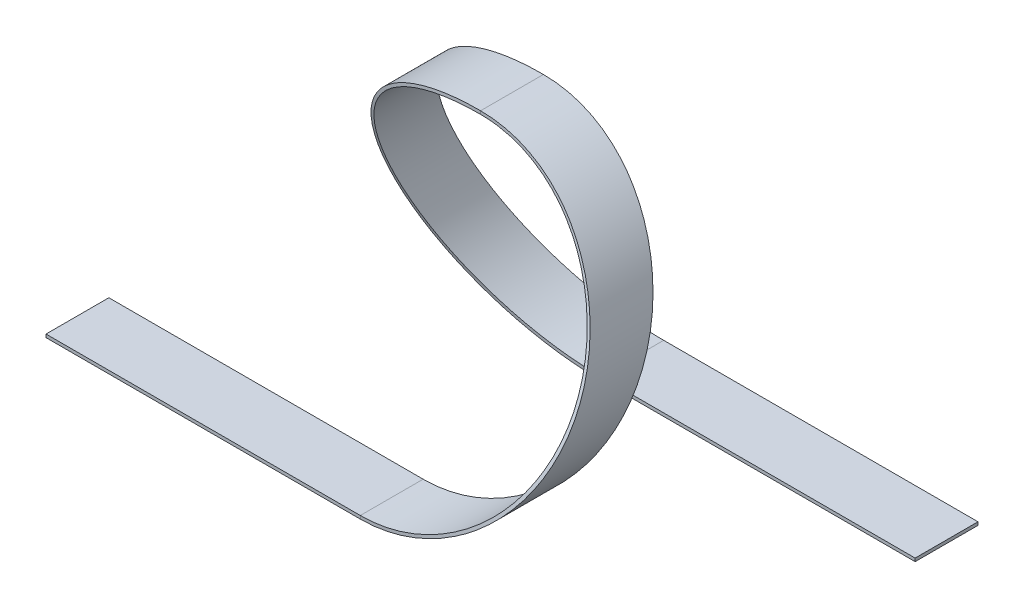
ISO-10303-21;
HEADER;
FILE_DESCRIPTION(('STEP AP214'),'2;1');
FILE_NAME('part.step','',(''),(''),'','','');
FILE_SCHEMA(('AUTOMOTIVE_DESIGN { 1 0 10303 214 1 1 1 1 }'));
ENDSEC;
DATA;
#1=APPLICATION_CONTEXT('core data for automotive mechanical design processes');
#2=APPLICATION_PROTOCOL_DEFINITION('international standard','automotive_design',2000,#1);
#3=PRODUCT_CONTEXT('',#1,'mechanical');
#4=PRODUCT('Part','Part','',(#3));
#5=PRODUCT_RELATED_PRODUCT_CATEGORY('part','',(#4));
#6=PRODUCT_DEFINITION_FORMATION('','',#4);
#7=PRODUCT_DEFINITION_CONTEXT('part definition',#1,'design');
#8=PRODUCT_DEFINITION('design','',#6,#7);
#9=PRODUCT_DEFINITION_SHAPE('','',#8);
#10=(LENGTH_UNIT() NAMED_UNIT(*) SI_UNIT(.MILLI.,.METRE.));
#11=(NAMED_UNIT(*) PLANE_ANGLE_UNIT() SI_UNIT($,.RADIAN.));
#12=(NAMED_UNIT(*) SI_UNIT($,.STERADIAN.) SOLID_ANGLE_UNIT());
#13=UNCERTAINTY_MEASURE_WITH_UNIT(LENGTH_MEASURE(1.E-05),#10,'distance_accuracy_value','');
#14=(GEOMETRIC_REPRESENTATION_CONTEXT(3) GLOBAL_UNCERTAINTY_ASSIGNED_CONTEXT((#13)) GLOBAL_UNIT_ASSIGNED_CONTEXT((#10,
#11,#12)) REPRESENTATION_CONTEXT('',''));
#15=CARTESIAN_POINT('',(0.,0.,0.));
#16=DIRECTION('',(0.,0.,1.));
#17=DIRECTION('',(1.,0.,0.));
#18=AXIS2_PLACEMENT_3D('',#15,#16,#17);
#19=CARTESIAN_POINT('',(100.,-0.499999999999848,-86.5366864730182));
#20=DIRECTION('',(0.,-1.,0.));
#21=DIRECTION('',(0.,0.,-1.));
#22=AXIS2_PLACEMENT_3D('',#19,#20,#21);
#23=PLANE('',#22);
#24=DIRECTION('',(0.,0.,-1.));
#25=VECTOR('',#24,1.);
#26=CARTESIAN_POINT('',(100.,-0.499999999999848,-86.5366864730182));
#27=LINE('',#26,#25);
#28=CARTESIAN_POINT('',(99.9999999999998,-0.499999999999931,-66.5366864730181));
#29=VERTEX_POINT('',#28);
#30=CARTESIAN_POINT('',(99.9999999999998,-0.499999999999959,-86.5366864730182));
#31=VERTEX_POINT('',#30);
#32=EDGE_CURVE('E219',#29,#31,#27,.T.);
#33=ORIENTED_EDGE('',*,*,#32,.T.);
#34=DIRECTION('',(1.,0.,0.));
#35=VECTOR('',#34,1.);
#36=CARTESIAN_POINT('',(99.9999999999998,-0.499999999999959,-86.5366864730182));
#37=LINE('',#36,#35);
#38=CARTESIAN_POINT('',(200.,-0.499999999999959,-86.5366864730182));
#39=VERTEX_POINT('',#38);
#40=EDGE_CURVE('E88',#31,#39,#37,.T.);
#41=ORIENTED_EDGE('',*,*,#40,.T.);
#42=DIRECTION('',(0.,0.,-1.));
#43=VECTOR('',#42,1.);
#44=CARTESIAN_POINT('',(200.,-0.499999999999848,-86.5366864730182));
#45=LINE('',#44,#43);
#46=CARTESIAN_POINT('',(200.,-0.499999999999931,-66.5366864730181));
#47=VERTEX_POINT('',#46);
#48=EDGE_CURVE('E95',#47,#39,#45,.T.);
#49=ORIENTED_EDGE('',*,*,#48,.F.);
#50=DIRECTION('',(1.,0.,0.));
#51=VECTOR('',#50,1.);
#52=CARTESIAN_POINT('',(99.9999999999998,-0.499999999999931,-66.5366864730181));
#53=LINE('',#52,#51);
#54=EDGE_CURVE('E12',#29,#47,#53,.T.);
#55=ORIENTED_EDGE('',*,*,#54,.F.);
#56=EDGE_LOOP('',(#33,#41,#49,#55));
#57=FACE_BOUND('',#56,.T.);
#58=ADVANCED_FACE('F81',(#57),#23,.T.);
#59=CARTESIAN_POINT('',(100.,-0.499999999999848,-86.5366864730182));
#60=DIRECTION('',(0.,0.,-1.));
#61=DIRECTION('',(-1.,0.,0.));
#62=AXIS2_PLACEMENT_3D('',#59,#60,#61);
#63=PLANE('',#62);
#64=DIRECTION('',(0.,1.,0.));
#65=VECTOR('',#64,1.);
#66=CARTESIAN_POINT('',(100.,-0.499999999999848,-86.5366864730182));
#67=LINE('',#66,#65);
#68=CARTESIAN_POINT('',(100.,0.500000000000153,-86.5366864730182));
#69=VERTEX_POINT('',#68);
#70=EDGE_CURVE('E195',#31,#69,#67,.T.);
#71=ORIENTED_EDGE('',*,*,#70,.T.);
#72=DIRECTION('',(1.,0.,0.));
#73=VECTOR('',#72,1.);
#74=CARTESIAN_POINT('',(100.,0.500000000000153,-86.5366864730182));
#75=LINE('',#74,#73);
#76=CARTESIAN_POINT('',(200.,0.500000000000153,-86.5366864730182));
#77=VERTEX_POINT('',#76);
#78=EDGE_CURVE('E294',#69,#77,#75,.T.);
#79=ORIENTED_EDGE('',*,*,#78,.T.);
#80=DIRECTION('',(0.,1.,0.));
#81=VECTOR('',#80,1.);
#82=CARTESIAN_POINT('',(200.,-0.499999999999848,-86.5366864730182));
#83=LINE('',#82,#81);
#84=EDGE_CURVE('E103',#39,#77,#83,.T.);
#85=ORIENTED_EDGE('',*,*,#84,.F.);
#86=ORIENTED_EDGE('',*,*,#40,.F.);
#87=EDGE_LOOP('',(#71,#79,#85,#86));
#88=FACE_BOUND('',#87,.T.);
#89=ADVANCED_FACE('F295',(#88),#63,.T.);
#90=CARTESIAN_POINT('',(100.,0.500000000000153,-86.5366864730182));
#91=DIRECTION('',(0.,1.,0.));
#92=DIRECTION('',(0.,0.,1.));
#93=AXIS2_PLACEMENT_3D('',#90,#91,#92);
#94=PLANE('',#93);
#95=DIRECTION('',(0.,0.,1.));
#96=VECTOR('',#95,1.);
#97=CARTESIAN_POINT('',(100.,0.500000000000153,-86.5366864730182));
#98=LINE('',#97,#96);
#99=CARTESIAN_POINT('',(100.,0.500000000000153,-66.5366864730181));
#100=VERTEX_POINT('',#99);
#101=EDGE_CURVE('E200',#69,#100,#98,.T.);
#102=ORIENTED_EDGE('',*,*,#101,.T.);
#103=DIRECTION('',(1.,0.,0.));
#104=VECTOR('',#103,1.);
#105=CARTESIAN_POINT('',(100.,0.500000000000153,-66.5366864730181));
#106=LINE('',#105,#104);
#107=CARTESIAN_POINT('',(200.,0.500000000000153,-66.5366864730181));
#108=VERTEX_POINT('',#107);
#109=EDGE_CURVE('E291',#100,#108,#106,.T.);
#110=ORIENTED_EDGE('',*,*,#109,.T.);
#111=DIRECTION('',(0.,0.,1.));
#112=VECTOR('',#111,1.);
#113=CARTESIAN_POINT('',(200.,0.500000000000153,-86.5366864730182));
#114=LINE('',#113,#112);
#115=EDGE_CURVE('E286',#77,#108,#114,.T.);
#116=ORIENTED_EDGE('',*,*,#115,.F.);
#117=ORIENTED_EDGE('',*,*,#78,.F.);
#118=EDGE_LOOP('',(#102,#110,#116,#117));
#119=FACE_BOUND('',#118,.T.);
#120=ADVANCED_FACE('F303',(#119),#94,.T.);
#121=CARTESIAN_POINT('',(100.,-0.499999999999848,-66.5366864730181));
#122=DIRECTION('',(0.,0.,1.));
#123=DIRECTION('',(1.,0.,0.));
#124=AXIS2_PLACEMENT_3D('',#121,#122,#123);
#125=PLANE('',#124);
#126=DIRECTION('',(0.,-1.,0.));
#127=VECTOR('',#126,1.);
#128=CARTESIAN_POINT('',(100.,-0.499999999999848,-66.5366864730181));
#129=LINE('',#128,#127);
#130=EDGE_CURVE('E213',#100,#29,#129,.T.);
#131=ORIENTED_EDGE('',*,*,#130,.T.);
#132=ORIENTED_EDGE('',*,*,#54,.T.);
#133=DIRECTION('',(0.,-1.,0.));
#134=VECTOR('',#133,1.);
#135=CARTESIAN_POINT('',(200.,-0.499999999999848,-66.5366864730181));
#136=LINE('',#135,#134);
#137=EDGE_CURVE('E284',#108,#47,#136,.T.);
#138=ORIENTED_EDGE('',*,*,#137,.F.);
#139=ORIENTED_EDGE('',*,*,#109,.F.);
#140=EDGE_LOOP('',(#131,#132,#138,#139));
#141=FACE_BOUND('',#140,.T.);
#142=ADVANCED_FACE('F307',(#141),#125,.T.);
#143=CARTESIAN_POINT('',(100.,-0.500000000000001,10.));
#144=DIRECTION('',(0.,0.,-1.));
#145=DIRECTION('',(-1.,0.,0.));
#146=AXIS2_PLACEMENT_3D('',#143,#144,#145);
#147=PLANE('',#146);
#148=DIRECTION('',(0.,-1.,0.));
#149=VECTOR('',#148,1.);
#150=CARTESIAN_POINT('',(0.,-0.500000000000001,10.));
#151=LINE('',#150,#149);
#152=CARTESIAN_POINT('',(0.,0.499999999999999,10.));
#153=VERTEX_POINT('',#152);
#154=CARTESIAN_POINT('',(0.,-0.500000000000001,10.));
#155=VERTEX_POINT('',#154);
#156=EDGE_CURVE('E230',#153,#155,#151,.T.);
#157=ORIENTED_EDGE('',*,*,#156,.T.);
#158=DIRECTION('',(-1.,0.,0.));
#159=VECTOR('',#158,1.);
#160=CARTESIAN_POINT('',(100.,-0.500000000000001,10.));
#161=LINE('',#160,#159);
#162=CARTESIAN_POINT('',(100.,-0.500000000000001,10.));
#163=VERTEX_POINT('',#162);
#164=EDGE_CURVE('E281',#163,#155,#161,.T.);
#165=ORIENTED_EDGE('',*,*,#164,.F.);
#166=DIRECTION('',(0.,-1.,0.));
#167=VECTOR('',#166,1.);
#168=CARTESIAN_POINT('',(100.,-0.500000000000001,10.));
#169=LINE('',#168,#167);
#170=CARTESIAN_POINT('',(100.,0.499999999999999,10.));
#171=VERTEX_POINT('',#170);
#172=EDGE_CURVE('E255',#171,#163,#169,.T.);
#173=ORIENTED_EDGE('',*,*,#172,.F.);
#174=DIRECTION('',(-1.,0.,0.));
#175=VECTOR('',#174,1.);
#176=CARTESIAN_POINT('',(100.,0.499999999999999,10.));
#177=LINE('',#176,#175);
#178=EDGE_CURVE('E265',#171,#153,#177,.T.);
#179=ORIENTED_EDGE('',*,*,#178,.T.);
#180=EDGE_LOOP('',(#157,#165,#173,#179));
#181=FACE_BOUND('',#180,.T.);
#182=ADVANCED_FACE('F338',(#181),#147,.F.);
#183=CARTESIAN_POINT('',(100.,-0.499999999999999,-10.));
#184=DIRECTION('',(0.,1.,0.));
#185=DIRECTION('',(0.,0.,1.));
#186=AXIS2_PLACEMENT_3D('',#183,#184,#185);
#187=PLANE('',#186);
#188=DIRECTION('',(0.,0.,-1.));
#189=VECTOR('',#188,1.);
#190=CARTESIAN_POINT('',(0.,-0.499999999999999,-10.));
#191=LINE('',#190,#189);
#192=CARTESIAN_POINT('',(0.,-0.499999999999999,-10.));
#193=VERTEX_POINT('',#192);
#194=EDGE_CURVE('E268',#155,#193,#191,.T.);
#195=ORIENTED_EDGE('',*,*,#194,.T.);
#196=DIRECTION('',(-1.,0.,0.));
#197=VECTOR('',#196,1.);
#198=CARTESIAN_POINT('',(100.,-0.499999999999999,-10.));
#199=LINE('',#198,#197);
#200=CARTESIAN_POINT('',(100.,-0.499999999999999,-10.));
#201=VERTEX_POINT('',#200);
#202=EDGE_CURVE('E278',#201,#193,#199,.T.);
#203=ORIENTED_EDGE('',*,*,#202,.F.);
#204=DIRECTION('',(0.,0.,-1.));
#205=VECTOR('',#204,1.);
#206=CARTESIAN_POINT('',(100.,-0.499999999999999,-10.));
#207=LINE('',#206,#205);
#208=EDGE_CURVE('E165',#163,#201,#207,.T.);
#209=ORIENTED_EDGE('',*,*,#208,.F.);
#210=ORIENTED_EDGE('',*,*,#164,.T.);
#211=EDGE_LOOP('',(#195,#203,#209,#210));
#212=FACE_BOUND('',#211,.T.);
#213=ADVANCED_FACE('F341',(#212),#187,.F.);
#214=CARTESIAN_POINT('',(100.,-0.499999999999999,-10.));
#215=DIRECTION('',(0.,0.,1.));
#216=DIRECTION('',(1.,0.,0.));
#217=AXIS2_PLACEMENT_3D('',#214,#215,#216);
#218=PLANE('',#217);
#219=DIRECTION('',(0.,1.,0.));
#220=VECTOR('',#219,1.);
#221=CARTESIAN_POINT('',(0.,-0.499999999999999,-10.));
#222=LINE('',#221,#220);
#223=CARTESIAN_POINT('',(0.,0.500000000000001,-10.));
#224=VERTEX_POINT('',#223);
#225=EDGE_CURVE('E270',#193,#224,#222,.T.);
#226=ORIENTED_EDGE('',*,*,#225,.T.);
#227=DIRECTION('',(-1.,0.,0.));
#228=VECTOR('',#227,1.);
#229=CARTESIAN_POINT('',(100.,0.500000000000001,-10.));
#230=LINE('',#229,#228);
#231=CARTESIAN_POINT('',(100.,0.500000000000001,-10.));
#232=VERTEX_POINT('',#231);
#233=EDGE_CURVE('E275',#232,#224,#230,.T.);
#234=ORIENTED_EDGE('',*,*,#233,.F.);
#235=DIRECTION('',(0.,1.,0.));
#236=VECTOR('',#235,1.);
#237=CARTESIAN_POINT('',(100.,-0.499999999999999,-10.));
#238=LINE('',#237,#236);
#239=EDGE_CURVE('E260',#201,#232,#238,.T.);
#240=ORIENTED_EDGE('',*,*,#239,.F.);
#241=ORIENTED_EDGE('',*,*,#202,.T.);
#242=EDGE_LOOP('',(#226,#234,#240,#241));
#243=FACE_BOUND('',#242,.T.);
#244=ADVANCED_FACE('F345',(#243),#218,.F.);
#245=CARTESIAN_POINT('',(100.,0.500000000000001,-10.));
#246=DIRECTION('',(0.,-1.,0.));
#247=DIRECTION('',(0.,0.,-1.));
#248=AXIS2_PLACEMENT_3D('',#245,#246,#247);
#249=PLANE('',#248);
#250=DIRECTION('',(0.,0.,1.));
#251=VECTOR('',#250,1.);
#252=CARTESIAN_POINT('',(0.,0.500000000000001,-10.));
#253=LINE('',#252,#251);
#254=EDGE_CURVE('E258',#224,#153,#253,.T.);
#255=ORIENTED_EDGE('',*,*,#254,.T.);
#256=ORIENTED_EDGE('',*,*,#178,.F.);
#257=DIRECTION('',(0.,0.,1.));
#258=VECTOR('',#257,1.);
#259=CARTESIAN_POINT('',(100.,0.500000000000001,-10.));
#260=LINE('',#259,#258);
#261=EDGE_CURVE('E262',#232,#171,#260,.T.);
#262=ORIENTED_EDGE('',*,*,#261,.F.);
#263=ORIENTED_EDGE('',*,*,#233,.T.);
#264=EDGE_LOOP('',(#255,#256,#262,#263));
#265=FACE_BOUND('',#264,.T.);
#266=ADVANCED_FACE('F349',(#265),#249,.F.);
#267=CARTESIAN_POINT('',(0.,0.499999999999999,10.));
#268=DIRECTION('',(1.,0.,0.));
#269=DIRECTION('',(0.,0.,-1.));
#270=AXIS2_PLACEMENT_3D('',#267,#268,#269);
#271=PLANE('',#270);
#272=ORIENTED_EDGE('',*,*,#156,.F.);
#273=ORIENTED_EDGE('',*,*,#254,.F.);
#274=ORIENTED_EDGE('',*,*,#225,.F.);
#275=ORIENTED_EDGE('',*,*,#194,.F.);
#276=EDGE_LOOP('',(#272,#273,#274,#275));
#277=FACE_BOUND('',#276,.T.);
#278=ADVANCED_FACE('F321',(#277),#271,.F.);
#279=CARTESIAN_POINT('',(100.,0.500000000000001,-10.));
#280=CARTESIAN_POINT('',(102.063382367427,0.499364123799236,-10.));
#281=CARTESIAN_POINT('',(106.463480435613,0.732141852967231,-10.0969464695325));
#282=CARTESIAN_POINT('',(111.334021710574,1.64723868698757,-10.4796299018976));
#283=CARTESIAN_POINT('',(116.405794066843,3.01383843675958,-11.0511038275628));
#284=CARTESIAN_POINT('',(119.037478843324,3.92585934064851,-11.4324660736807));
#285=CARTESIAN_POINT('',(124.372084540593,6.32853062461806,-12.4373663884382));
#286=CARTESIAN_POINT('',(127.075288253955,7.82054021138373,-13.0614674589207));
#287=CARTESIAN_POINT('',(132.35516733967,11.4790110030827,-14.5922011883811));
#288=CARTESIAN_POINT('',(134.931082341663,13.6472332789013,-15.4995633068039));
#289=CARTESIAN_POINT('',(139.684438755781,18.6791727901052,-17.6060336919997));
#290=CARTESIAN_POINT('',(141.859610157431,21.5442165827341,-18.8056914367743));
#291=CARTESIAN_POINT('',(145.509630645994,27.8670044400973,-21.4540196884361));
#292=CARTESIAN_POINT('',(146.981195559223,31.3243992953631,-22.9025455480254));
#293=CARTESIAN_POINT('',(148.977649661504,38.5869647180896,-25.9458978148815));
#294=CARTESIAN_POINT('',(149.5,42.3895595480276,-27.5396573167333));
#295=CARTESIAN_POINT('',(149.5,49.998393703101,-30.7286859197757));
#296=CARTESIAN_POINT('',(148.977649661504,53.8009885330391,-32.3224454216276));
#297=CARTESIAN_POINT('',(146.981195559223,61.0635539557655,-35.3657976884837));
#298=CARTESIAN_POINT('',(145.509630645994,64.5209488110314,-36.814323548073));
#299=CARTESIAN_POINT('',(141.859610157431,70.8437366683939,-39.4626517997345));
#300=CARTESIAN_POINT('',(139.684438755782,73.7087804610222,-40.6623095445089));
#301=CARTESIAN_POINT('',(134.931082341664,78.7407199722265,-42.7687799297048));
#302=CARTESIAN_POINT('',(132.35516733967,80.908942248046,-43.676142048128));
#303=CARTESIAN_POINT('',(127.075288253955,84.5674130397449,-45.2068757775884));
#304=CARTESIAN_POINT('',(124.372084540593,86.0594226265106,-45.8309768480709));
#305=CARTESIAN_POINT('',(119.037478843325,88.4620939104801,-46.8358771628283));
#306=CARTESIAN_POINT('',(116.405794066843,89.3741148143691,-47.2172394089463));
#307=CARTESIAN_POINT('',(111.334021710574,90.7407145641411,-47.7887133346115));
#308=CARTESIAN_POINT('',(106.463480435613,91.6558113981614,-48.1713967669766));
#309=CARTESIAN_POINT('',(102.063382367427,91.8885891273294,-48.2683432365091));
#310=CARTESIAN_POINT('',(100.,91.8879532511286,-48.2683432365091));
#311=CARTESIAN_POINT('',(100.,0.499999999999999,10.));
#312=CARTESIAN_POINT('',(102.063382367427,0.499364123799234,10.));
#313=CARTESIAN_POINT('',(106.463480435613,0.73214185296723,9.90305353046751));
#314=CARTESIAN_POINT('',(111.334021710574,1.64723868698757,9.52037009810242));
#315=CARTESIAN_POINT('',(116.405794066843,3.01383843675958,8.94889617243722));
#316=CARTESIAN_POINT('',(119.037478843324,3.92585934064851,8.56753392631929));
#317=CARTESIAN_POINT('',(124.372084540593,6.32853062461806,7.56263361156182));
#318=CARTESIAN_POINT('',(127.075288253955,7.82054021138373,6.93853254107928));
#319=CARTESIAN_POINT('',(132.35516733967,11.4790110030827,5.40779881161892));
#320=CARTESIAN_POINT('',(134.931082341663,13.6472332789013,4.50043669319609));
#321=CARTESIAN_POINT('',(139.684438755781,18.6791727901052,2.39396630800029));
#322=CARTESIAN_POINT('',(141.859610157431,21.5442165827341,1.19430856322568));
#323=CARTESIAN_POINT('',(145.509630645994,27.8670044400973,-1.4540196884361));
#324=CARTESIAN_POINT('',(146.981195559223,31.3243992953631,-2.90254554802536));
#325=CARTESIAN_POINT('',(148.977649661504,38.5869647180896,-5.94589781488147));
#326=CARTESIAN_POINT('',(149.5,42.3895595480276,-7.53965731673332));
#327=CARTESIAN_POINT('',(149.5,49.998393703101,-10.7286859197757));
#328=CARTESIAN_POINT('',(148.977649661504,53.8009885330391,-12.3224454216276));
#329=CARTESIAN_POINT('',(146.981195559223,61.0635539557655,-15.3657976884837));
#330=CARTESIAN_POINT('',(145.509630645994,64.5209488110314,-16.814323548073));
#331=CARTESIAN_POINT('',(141.859610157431,70.8437366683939,-19.4626517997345));
#332=CARTESIAN_POINT('',(139.684438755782,73.7087804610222,-20.6623095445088));
#333=CARTESIAN_POINT('',(134.931082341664,78.7407199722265,-22.7687799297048));
#334=CARTESIAN_POINT('',(132.35516733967,80.908942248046,-23.676142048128));
#335=CARTESIAN_POINT('',(127.075288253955,84.5674130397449,-25.2068757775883));
#336=CARTESIAN_POINT('',(124.372084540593,86.0594226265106,-25.8309768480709));
#337=CARTESIAN_POINT('',(119.037478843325,88.4620939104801,-26.8358771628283));
#338=CARTESIAN_POINT('',(116.405794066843,89.3741148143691,-27.2172394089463));
#339=CARTESIAN_POINT('',(111.334021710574,90.7407145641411,-27.7887133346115));
#340=CARTESIAN_POINT('',(106.463480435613,91.6558113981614,-28.1713967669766));
#341=CARTESIAN_POINT('',(102.063382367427,91.8885891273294,-28.2683432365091));
#342=CARTESIAN_POINT('',(100.,91.8879532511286,-28.2683432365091));
#343=B_SPLINE_SURFACE_WITH_KNOTS('',1,3,((#279,#280,#281,#282,#283,#284,#285,#286,#287,#288,
#289,#290,#291,#292,#293,#294,#295,#296,#297,#298,#299,#300,#301,#302,#303,#304,#305,#306,#307,
#308,#309,#310),(#311,#312,#313,#314,#315,#316,#317,#318,#319,#320,#321,#322,#323,#324,#325,
#326,#327,#328,#329,#330,#331,#332,#333,#334,#335,#336,#337,#338,#339,#340,#341,#342)),
.UNSPECIFIED.,.F.,.F.,.F.,(2,2),(4,1,2,2,2,2,2,2,2,2,2,2,2,2,2,1,4),(0.523809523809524,1.),(0.,
0.0624999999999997,0.125,0.1875,0.25000000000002,0.3125,0.375,0.4375,0.5,0.5625,0.625,0.6875,
0.75,0.8125,0.875,0.9375,1.),.UNSPECIFIED.);
#344=CARTESIAN_POINT('',(100.,0.499999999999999,10.));
#345=CARTESIAN_POINT('',(102.063382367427,0.499364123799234,10.));
#346=CARTESIAN_POINT('',(106.463480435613,0.73214185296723,9.90305353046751));
#347=CARTESIAN_POINT('',(111.334021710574,1.64723868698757,9.52037009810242));
#348=CARTESIAN_POINT('',(116.405794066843,3.01383843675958,8.94889617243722));
#349=CARTESIAN_POINT('',(119.037478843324,3.92585934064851,8.56753392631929));
#350=CARTESIAN_POINT('',(124.372084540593,6.32853062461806,7.56263361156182));
#351=CARTESIAN_POINT('',(127.075288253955,7.82054021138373,6.93853254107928));
#352=CARTESIAN_POINT('',(132.35516733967,11.4790110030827,5.40779881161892));
#353=CARTESIAN_POINT('',(134.931082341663,13.6472332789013,4.50043669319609));
#354=CARTESIAN_POINT('',(139.684438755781,18.6791727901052,2.39396630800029));
#355=CARTESIAN_POINT('',(141.859610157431,21.5442165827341,1.19430856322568));
#356=CARTESIAN_POINT('',(145.509630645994,27.8670044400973,-1.4540196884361));
#357=CARTESIAN_POINT('',(146.981195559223,31.3243992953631,-2.90254554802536));
#358=CARTESIAN_POINT('',(148.977649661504,38.5869647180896,-5.94589781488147));
#359=CARTESIAN_POINT('',(149.5,42.3895595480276,-7.53965731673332));
#360=CARTESIAN_POINT('',(149.5,49.998393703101,-10.7286859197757));
#361=CARTESIAN_POINT('',(148.977649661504,53.8009885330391,-12.3224454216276));
#362=CARTESIAN_POINT('',(146.981195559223,61.0635539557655,-15.3657976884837));
#363=CARTESIAN_POINT('',(145.509630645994,64.5209488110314,-16.814323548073));
#364=CARTESIAN_POINT('',(141.859610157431,70.8437366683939,-19.4626517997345));
#365=CARTESIAN_POINT('',(139.684438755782,73.7087804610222,-20.6623095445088));
#366=CARTESIAN_POINT('',(134.931082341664,78.7407199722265,-22.7687799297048));
#367=CARTESIAN_POINT('',(132.35516733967,80.908942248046,-23.676142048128));
#368=CARTESIAN_POINT('',(127.075288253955,84.5674130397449,-25.2068757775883));
#369=CARTESIAN_POINT('',(124.372084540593,86.0594226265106,-25.8309768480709));
#370=CARTESIAN_POINT('',(119.037478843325,88.4620939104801,-26.8358771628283));
#371=CARTESIAN_POINT('',(116.405794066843,89.3741148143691,-27.2172394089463));
#372=CARTESIAN_POINT('',(111.334021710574,90.7407145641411,-27.7887133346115));
#373=CARTESIAN_POINT('',(106.463480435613,91.6558113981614,-28.1713967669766));
#374=CARTESIAN_POINT('',(102.063382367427,91.8885891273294,-28.2683432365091));
#375=CARTESIAN_POINT('',(100.,91.8879532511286,-28.2683432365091));
#376=B_SPLINE_CURVE_WITH_KNOTS('',3,(#344,#345,#346,#347,#348,#349,#350,#351,#352,#353,#354,
#355,#356,#357,#358,#359,#360,#361,#362,#363,#364,#365,#366,#367,#368,#369,#370,#371,#372,#373,
#374,#375),.UNSPECIFIED.,.F.,.F.,(4,1,2,2,2,2,2,2,2,2,2,2,2,2,2,1,4),(0.,0.0624999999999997,
0.125,0.1875,0.25000000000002,0.3125,0.375,0.4375,0.5,0.5625,0.625,0.6875,0.75,0.8125,0.875,
0.9375,1.),.UNSPECIFIED.);
#377=CARTESIAN_POINT('',(100.,91.8879532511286,-28.2683432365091));
#378=VERTEX_POINT('',#377);
#379=EDGE_CURVE('E225',#171,#378,#376,.T.);
#380=DIRECTION('',(0.,0.,1.));
#381=VECTOR('',#380,1.);
#382=CARTESIAN_POINT('',(100.,91.8879532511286,-48.2683432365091));
#383=LINE('',#382,#381);
#384=CARTESIAN_POINT('',(100.,91.8879532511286,-48.2683432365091));
#385=VERTEX_POINT('',#384);
#386=EDGE_CURVE('E180',#385,#378,#383,.T.);
#387=CARTESIAN_POINT('',(100.,0.500000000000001,-10.));
#388=CARTESIAN_POINT('',(102.063382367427,0.499364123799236,-10.));
#389=CARTESIAN_POINT('',(106.463480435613,0.732141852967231,-10.0969464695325));
#390=CARTESIAN_POINT('',(111.334021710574,1.64723868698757,-10.4796299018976));
#391=CARTESIAN_POINT('',(116.405794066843,3.01383843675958,-11.0511038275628));
#392=CARTESIAN_POINT('',(119.037478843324,3.92585934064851,-11.4324660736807));
#393=CARTESIAN_POINT('',(124.372084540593,6.32853062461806,-12.4373663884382));
#394=CARTESIAN_POINT('',(127.075288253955,7.82054021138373,-13.0614674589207));
#395=CARTESIAN_POINT('',(132.35516733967,11.4790110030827,-14.5922011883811));
#396=CARTESIAN_POINT('',(134.931082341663,13.6472332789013,-15.4995633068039));
#397=CARTESIAN_POINT('',(139.684438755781,18.6791727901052,-17.6060336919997));
#398=CARTESIAN_POINT('',(141.859610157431,21.5442165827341,-18.8056914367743));
#399=CARTESIAN_POINT('',(145.509630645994,27.8670044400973,-21.4540196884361));
#400=CARTESIAN_POINT('',(146.981195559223,31.3243992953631,-22.9025455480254));
#401=CARTESIAN_POINT('',(148.977649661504,38.5869647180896,-25.9458978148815));
#402=CARTESIAN_POINT('',(149.5,42.3895595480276,-27.5396573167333));
#403=CARTESIAN_POINT('',(149.5,49.998393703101,-30.7286859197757));
#404=CARTESIAN_POINT('',(148.977649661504,53.8009885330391,-32.3224454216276));
#405=CARTESIAN_POINT('',(146.981195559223,61.0635539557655,-35.3657976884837));
#406=CARTESIAN_POINT('',(145.509630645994,64.5209488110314,-36.814323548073));
#407=CARTESIAN_POINT('',(141.859610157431,70.8437366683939,-39.4626517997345));
#408=CARTESIAN_POINT('',(139.684438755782,73.7087804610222,-40.6623095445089));
#409=CARTESIAN_POINT('',(134.931082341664,78.7407199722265,-42.7687799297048));
#410=CARTESIAN_POINT('',(132.35516733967,80.908942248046,-43.676142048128));
#411=CARTESIAN_POINT('',(127.075288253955,84.5674130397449,-45.2068757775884));
#412=CARTESIAN_POINT('',(124.372084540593,86.0594226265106,-45.8309768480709));
#413=CARTESIAN_POINT('',(119.037478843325,88.4620939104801,-46.8358771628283));
#414=CARTESIAN_POINT('',(116.405794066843,89.3741148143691,-47.2172394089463));
#415=CARTESIAN_POINT('',(111.334021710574,90.7407145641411,-47.7887133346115));
#416=CARTESIAN_POINT('',(106.463480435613,91.6558113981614,-48.1713967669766));
#417=CARTESIAN_POINT('',(102.063382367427,91.8885891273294,-48.2683432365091));
#418=CARTESIAN_POINT('',(100.,91.8879532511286,-48.2683432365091));
#419=B_SPLINE_CURVE_WITH_KNOTS('',3,(#387,#388,#389,#390,#391,#392,#393,#394,#395,#396,#397,
#398,#399,#400,#401,#402,#403,#404,#405,#406,#407,#408,#409,#410,#411,#412,#413,#414,#415,#416,
#417,#418),.UNSPECIFIED.,.F.,.F.,(4,1,2,2,2,2,2,2,2,2,2,2,2,2,2,1,4),(0.,0.0624999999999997,
0.125,0.1875,0.25000000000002,0.3125,0.375,0.4375,0.5,0.5625,0.625,0.6875,0.75,0.8125,0.875,
0.9375,1.),.UNSPECIFIED.);
#420=EDGE_CURVE('E168',#232,#385,#419,.T.);
#421=ORIENTED_EDGE('',*,*,#261,.T.);
#422=ORIENTED_EDGE('',*,*,#379,.T.);
#423=ORIENTED_EDGE('',*,*,#386,.F.);
#424=ORIENTED_EDGE('',*,*,#420,.F.);
#425=EDGE_LOOP('',(#421,#422,#423,#424));
#426=FACE_BOUND('',#425,.T.);
#427=ADVANCED_FACE('F313',(#426),#343,.T.);
#428=CARTESIAN_POINT('',(100.,-0.499999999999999,-10.));
#429=CARTESIAN_POINT('',(102.10328429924,-0.499364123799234,-10.));
#430=CARTESIAN_POINT('',(106.583186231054,-0.264042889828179,-10.0969464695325));
#431=CARTESIAN_POINT('',(111.545978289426,0.668619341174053,-10.4796299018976));
#432=CARTESIAN_POINT('',(116.714205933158,2.06133979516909,-11.0511038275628));
#433=CARTESIAN_POINT('',(119.396220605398,2.9906987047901,-11.4324660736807));
#434=CARTESIAN_POINT('',(124.834665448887,5.44011535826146,-12.4373663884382));
#435=CARTESIAN_POINT('',(127.591378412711,6.96153230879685,-13.0614674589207));
#436=CARTESIAN_POINT('',(132.978165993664,10.6940977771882,-14.5922011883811));
#437=CARTESIAN_POINT('',(135.607480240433,12.9070073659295,-15.4995633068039));
#438=CARTESIAN_POINT('',(140.461930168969,18.0460066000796,-17.6060336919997));
#439=CARTESIAN_POINT('',(142.684795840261,20.9734228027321,-18.8056914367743));
#440=CARTESIAN_POINT('',(146.416551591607,27.4378949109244,-21.4540196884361));
#441=CARTESIAN_POINT('',(147.922157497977,30.9746016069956,-22.9025455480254));
#442=CARTESIAN_POINT('',(149.965151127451,38.4066408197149,-25.9458978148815));
#443=CARTESIAN_POINT('',(150.5,42.2993975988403,-27.5396573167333));
#444=CARTESIAN_POINT('',(150.5,50.0885556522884,-30.7286859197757));
#445=CARTESIAN_POINT('',(149.965151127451,53.9813124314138,-32.3224454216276));
#446=CARTESIAN_POINT('',(147.922157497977,61.413351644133,-35.3657976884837));
#447=CARTESIAN_POINT('',(146.416551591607,64.9500583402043,-36.814323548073));
#448=CARTESIAN_POINT('',(142.684795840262,71.4145304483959,-39.4626517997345));
#449=CARTESIAN_POINT('',(140.46193016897,74.3419466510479,-40.6623095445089));
#450=CARTESIAN_POINT('',(135.607480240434,79.4809458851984,-42.7687799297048));
#451=CARTESIAN_POINT('',(132.978165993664,81.6938554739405,-43.676142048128));
#452=CARTESIAN_POINT('',(127.591378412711,85.4264209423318,-45.2068757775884));
#453=CARTESIAN_POINT('',(124.834665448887,86.9478378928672,-45.8309768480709));
#454=CARTESIAN_POINT('',(119.396220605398,89.3972545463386,-46.8358771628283));
#455=CARTESIAN_POINT('',(116.714205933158,90.3266134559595,-47.2172394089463));
#456=CARTESIAN_POINT('',(111.545978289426,91.7193339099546,-47.7887133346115));
#457=CARTESIAN_POINT('',(106.583186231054,92.6519961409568,-48.1713967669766));
#458=CARTESIAN_POINT('',(102.10328429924,92.8873173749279,-48.2683432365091));
#459=CARTESIAN_POINT('',(100.,92.8879532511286,-48.2683432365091));
#460=CARTESIAN_POINT('',(100.,0.500000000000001,-10.));
#461=CARTESIAN_POINT('',(102.063382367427,0.499364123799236,-10.));
#462=CARTESIAN_POINT('',(106.463480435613,0.732141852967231,-10.0969464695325));
#463=CARTESIAN_POINT('',(111.334021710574,1.64723868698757,-10.4796299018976));
#464=CARTESIAN_POINT('',(116.405794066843,3.01383843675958,-11.0511038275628));
#465=CARTESIAN_POINT('',(119.037478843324,3.92585934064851,-11.4324660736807));
#466=CARTESIAN_POINT('',(124.372084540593,6.32853062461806,-12.4373663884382));
#467=CARTESIAN_POINT('',(127.075288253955,7.82054021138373,-13.0614674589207));
#468=CARTESIAN_POINT('',(132.35516733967,11.4790110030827,-14.5922011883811));
#469=CARTESIAN_POINT('',(134.931082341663,13.6472332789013,-15.4995633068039));
#470=CARTESIAN_POINT('',(139.684438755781,18.6791727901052,-17.6060336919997));
#471=CARTESIAN_POINT('',(141.859610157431,21.5442165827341,-18.8056914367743));
#472=CARTESIAN_POINT('',(145.509630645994,27.8670044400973,-21.4540196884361));
#473=CARTESIAN_POINT('',(146.981195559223,31.3243992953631,-22.9025455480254));
#474=CARTESIAN_POINT('',(148.977649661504,38.5869647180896,-25.9458978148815));
#475=CARTESIAN_POINT('',(149.5,42.3895595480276,-27.5396573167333));
#476=CARTESIAN_POINT('',(149.5,49.998393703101,-30.7286859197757));
#477=CARTESIAN_POINT('',(148.977649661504,53.8009885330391,-32.3224454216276));
#478=CARTESIAN_POINT('',(146.981195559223,61.0635539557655,-35.3657976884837));
#479=CARTESIAN_POINT('',(145.509630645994,64.5209488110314,-36.814323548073));
#480=CARTESIAN_POINT('',(141.859610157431,70.8437366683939,-39.4626517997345));
#481=CARTESIAN_POINT('',(139.684438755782,73.7087804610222,-40.6623095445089));
#482=CARTESIAN_POINT('',(134.931082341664,78.7407199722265,-42.7687799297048));
#483=CARTESIAN_POINT('',(132.35516733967,80.908942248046,-43.676142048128));
#484=CARTESIAN_POINT('',(127.075288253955,84.5674130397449,-45.2068757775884));
#485=CARTESIAN_POINT('',(124.372084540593,86.0594226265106,-45.8309768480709));
#486=CARTESIAN_POINT('',(119.037478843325,88.4620939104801,-46.8358771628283));
#487=CARTESIAN_POINT('',(116.405794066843,89.3741148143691,-47.2172394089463));
#488=CARTESIAN_POINT('',(111.334021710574,90.7407145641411,-47.7887133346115));
#489=CARTESIAN_POINT('',(106.463480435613,91.6558113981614,-48.1713967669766));
#490=CARTESIAN_POINT('',(102.063382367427,91.8885891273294,-48.2683432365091));
#491=CARTESIAN_POINT('',(100.,91.8879532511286,-48.2683432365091));
#492=B_SPLINE_SURFACE_WITH_KNOTS('',1,3,((#428,#429,#430,#431,#432,#433,#434,#435,#436,#437,
#438,#439,#440,#441,#442,#443,#444,#445,#446,#447,#448,#449,#450,#451,#452,#453,#454,#455,#456,
#457,#458,#459),(#460,#461,#462,#463,#464,#465,#466,#467,#468,#469,#470,#471,#472,#473,#474,
#475,#476,#477,#478,#479,#480,#481,#482,#483,#484,#485,#486,#487,#488,#489,#490,#491)),
.UNSPECIFIED.,.F.,.F.,.F.,(2,2),(4,1,2,2,2,2,2,2,2,2,2,2,2,2,2,1,4),(0.5,0.523809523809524),(0.,
0.0624999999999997,0.125,0.1875,0.25000000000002,0.3125,0.375,0.4375,0.5,0.5625,0.625,0.6875,
0.75,0.8125,0.875,0.9375,1.),.UNSPECIFIED.);
#493=DIRECTION('',(0.,-1.,0.));
#494=VECTOR('',#493,1.);
#495=CARTESIAN_POINT('',(100.,92.8879532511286,-48.2683432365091));
#496=LINE('',#495,#494);
#497=CARTESIAN_POINT('',(100.,92.8879532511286,-48.2683432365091));
#498=VERTEX_POINT('',#497);
#499=EDGE_CURVE('E172',#498,#385,#496,.T.);
#500=CARTESIAN_POINT('',(100.,-0.499999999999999,-10.));
#501=CARTESIAN_POINT('',(102.10328429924,-0.499364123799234,-10.));
#502=CARTESIAN_POINT('',(106.583186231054,-0.264042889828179,-10.0969464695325));
#503=CARTESIAN_POINT('',(111.545978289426,0.668619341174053,-10.4796299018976));
#504=CARTESIAN_POINT('',(116.714205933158,2.06133979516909,-11.0511038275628));
#505=CARTESIAN_POINT('',(119.396220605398,2.9906987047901,-11.4324660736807));
#506=CARTESIAN_POINT('',(124.834665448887,5.44011535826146,-12.4373663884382));
#507=CARTESIAN_POINT('',(127.591378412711,6.96153230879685,-13.0614674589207));
#508=CARTESIAN_POINT('',(132.978165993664,10.6940977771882,-14.5922011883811));
#509=CARTESIAN_POINT('',(135.607480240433,12.9070073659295,-15.4995633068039));
#510=CARTESIAN_POINT('',(140.461930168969,18.0460066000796,-17.6060336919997));
#511=CARTESIAN_POINT('',(142.684795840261,20.9734228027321,-18.8056914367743));
#512=CARTESIAN_POINT('',(146.416551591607,27.4378949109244,-21.4540196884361));
#513=CARTESIAN_POINT('',(147.922157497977,30.9746016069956,-22.9025455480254));
#514=CARTESIAN_POINT('',(149.965151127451,38.4066408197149,-25.9458978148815));
#515=CARTESIAN_POINT('',(150.5,42.2993975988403,-27.5396573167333));
#516=CARTESIAN_POINT('',(150.5,50.0885556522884,-30.7286859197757));
#517=CARTESIAN_POINT('',(149.965151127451,53.9813124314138,-32.3224454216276));
#518=CARTESIAN_POINT('',(147.922157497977,61.413351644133,-35.3657976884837));
#519=CARTESIAN_POINT('',(146.416551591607,64.9500583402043,-36.814323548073));
#520=CARTESIAN_POINT('',(142.684795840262,71.4145304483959,-39.4626517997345));
#521=CARTESIAN_POINT('',(140.46193016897,74.3419466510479,-40.6623095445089));
#522=CARTESIAN_POINT('',(135.607480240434,79.4809458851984,-42.7687799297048));
#523=CARTESIAN_POINT('',(132.978165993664,81.6938554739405,-43.676142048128));
#524=CARTESIAN_POINT('',(127.591378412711,85.4264209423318,-45.2068757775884));
#525=CARTESIAN_POINT('',(124.834665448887,86.9478378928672,-45.8309768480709));
#526=CARTESIAN_POINT('',(119.396220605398,89.3972545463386,-46.8358771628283));
#527=CARTESIAN_POINT('',(116.714205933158,90.3266134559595,-47.2172394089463));
#528=CARTESIAN_POINT('',(111.545978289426,91.7193339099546,-47.7887133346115));
#529=CARTESIAN_POINT('',(106.583186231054,92.6519961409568,-48.1713967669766));
#530=CARTESIAN_POINT('',(102.10328429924,92.8873173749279,-48.2683432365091));
#531=CARTESIAN_POINT('',(100.,92.8879532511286,-48.2683432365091));
#532=B_SPLINE_CURVE_WITH_KNOTS('',3,(#500,#501,#502,#503,#504,#505,#506,#507,#508,#509,#510,
#511,#512,#513,#514,#515,#516,#517,#518,#519,#520,#521,#522,#523,#524,#525,#526,#527,#528,#529,
#530,#531),.UNSPECIFIED.,.F.,.F.,(4,1,2,2,2,2,2,2,2,2,2,2,2,2,2,1,4),(0.,0.0624999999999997,
0.125,0.1875,0.25000000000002,0.3125,0.375,0.4375,0.5,0.5625,0.625,0.6875,0.75,0.8125,0.875,
0.9375,1.),.UNSPECIFIED.);
#533=EDGE_CURVE('E158',#201,#498,#532,.T.);
#534=ORIENTED_EDGE('',*,*,#239,.T.);
#535=ORIENTED_EDGE('',*,*,#420,.T.);
#536=ORIENTED_EDGE('',*,*,#499,.F.);
#537=ORIENTED_EDGE('',*,*,#533,.F.);
#538=EDGE_LOOP('',(#534,#535,#536,#537));
#539=FACE_BOUND('',#538,.T.);
#540=ADVANCED_FACE('F173',(#539),#492,.T.);
#541=CARTESIAN_POINT('',(100.,-0.500000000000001,10.));
#542=CARTESIAN_POINT('',(102.10328429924,-0.499364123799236,10.));
#543=CARTESIAN_POINT('',(106.583186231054,-0.26404288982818,9.90305353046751));
#544=CARTESIAN_POINT('',(111.545978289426,0.668619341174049,9.52037009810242));
#545=CARTESIAN_POINT('',(116.714205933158,2.06133979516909,8.94889617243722));
#546=CARTESIAN_POINT('',(119.396220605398,2.9906987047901,8.56753392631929));
#547=CARTESIAN_POINT('',(124.834665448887,5.44011535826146,7.56263361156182));
#548=CARTESIAN_POINT('',(127.591378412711,6.96153230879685,6.93853254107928));
#549=CARTESIAN_POINT('',(132.978165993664,10.6940977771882,5.40779881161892));
#550=CARTESIAN_POINT('',(135.607480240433,12.9070073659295,4.50043669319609));
#551=CARTESIAN_POINT('',(140.461930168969,18.0460066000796,2.39396630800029));
#552=CARTESIAN_POINT('',(142.684795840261,20.9734228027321,1.19430856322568));
#553=CARTESIAN_POINT('',(146.416551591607,27.4378949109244,-1.4540196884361));
#554=CARTESIAN_POINT('',(147.922157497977,30.9746016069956,-2.90254554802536));
#555=CARTESIAN_POINT('',(149.965151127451,38.4066408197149,-5.94589781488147));
#556=CARTESIAN_POINT('',(150.5,42.2993975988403,-7.53965731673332));
#557=CARTESIAN_POINT('',(150.5,50.0885556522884,-10.7286859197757));
#558=CARTESIAN_POINT('',(149.965151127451,53.9813124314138,-12.3224454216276));
#559=CARTESIAN_POINT('',(147.922157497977,61.413351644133,-15.3657976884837));
#560=CARTESIAN_POINT('',(146.416551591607,64.9500583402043,-16.814323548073));
#561=CARTESIAN_POINT('',(142.684795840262,71.4145304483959,-19.4626517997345));
#562=CARTESIAN_POINT('',(140.46193016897,74.3419466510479,-20.6623095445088));
#563=CARTESIAN_POINT('',(135.607480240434,79.4809458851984,-22.7687799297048));
#564=CARTESIAN_POINT('',(132.978165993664,81.6938554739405,-23.676142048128));
#565=CARTESIAN_POINT('',(127.591378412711,85.4264209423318,-25.2068757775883));
#566=CARTESIAN_POINT('',(124.834665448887,86.9478378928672,-25.8309768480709));
#567=CARTESIAN_POINT('',(119.396220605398,89.3972545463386,-26.8358771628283));
#568=CARTESIAN_POINT('',(116.714205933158,90.3266134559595,-27.2172394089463));
#569=CARTESIAN_POINT('',(111.545978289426,91.7193339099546,-27.7887133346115));
#570=CARTESIAN_POINT('',(106.583186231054,92.6519961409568,-28.1713967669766));
#571=CARTESIAN_POINT('',(102.10328429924,92.8873173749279,-28.2683432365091));
#572=CARTESIAN_POINT('',(100.,92.8879532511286,-28.2683432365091));
#573=CARTESIAN_POINT('',(100.,-0.499999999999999,-10.));
#574=CARTESIAN_POINT('',(102.10328429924,-0.499364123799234,-10.));
#575=CARTESIAN_POINT('',(106.583186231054,-0.264042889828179,-10.0969464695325));
#576=CARTESIAN_POINT('',(111.545978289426,0.668619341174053,-10.4796299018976));
#577=CARTESIAN_POINT('',(116.714205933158,2.06133979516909,-11.0511038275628));
#578=CARTESIAN_POINT('',(119.396220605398,2.9906987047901,-11.4324660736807));
#579=CARTESIAN_POINT('',(124.834665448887,5.44011535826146,-12.4373663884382));
#580=CARTESIAN_POINT('',(127.591378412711,6.96153230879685,-13.0614674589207));
#581=CARTESIAN_POINT('',(132.978165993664,10.6940977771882,-14.5922011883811));
#582=CARTESIAN_POINT('',(135.607480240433,12.9070073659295,-15.4995633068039));
#583=CARTESIAN_POINT('',(140.461930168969,18.0460066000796,-17.6060336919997));
#584=CARTESIAN_POINT('',(142.684795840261,20.9734228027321,-18.8056914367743));
#585=CARTESIAN_POINT('',(146.416551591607,27.4378949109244,-21.4540196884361));
#586=CARTESIAN_POINT('',(147.922157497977,30.9746016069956,-22.9025455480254));
#587=CARTESIAN_POINT('',(149.965151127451,38.4066408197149,-25.9458978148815));
#588=CARTESIAN_POINT('',(150.5,42.2993975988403,-27.5396573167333));
#589=CARTESIAN_POINT('',(150.5,50.0885556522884,-30.7286859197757));
#590=CARTESIAN_POINT('',(149.965151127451,53.9813124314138,-32.3224454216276));
#591=CARTESIAN_POINT('',(147.922157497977,61.413351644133,-35.3657976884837));
#592=CARTESIAN_POINT('',(146.416551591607,64.9500583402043,-36.814323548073));
#593=CARTESIAN_POINT('',(142.684795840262,71.4145304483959,-39.4626517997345));
#594=CARTESIAN_POINT('',(140.46193016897,74.3419466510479,-40.6623095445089));
#595=CARTESIAN_POINT('',(135.607480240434,79.4809458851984,-42.7687799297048));
#596=CARTESIAN_POINT('',(132.978165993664,81.6938554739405,-43.676142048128));
#597=CARTESIAN_POINT('',(127.591378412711,85.4264209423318,-45.2068757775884));
#598=CARTESIAN_POINT('',(124.834665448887,86.9478378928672,-45.8309768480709));
#599=CARTESIAN_POINT('',(119.396220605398,89.3972545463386,-46.8358771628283));
#600=CARTESIAN_POINT('',(116.714205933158,90.3266134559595,-47.2172394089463));
#601=CARTESIAN_POINT('',(111.545978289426,91.7193339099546,-47.7887133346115));
#602=CARTESIAN_POINT('',(106.583186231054,92.6519961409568,-48.1713967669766));
#603=CARTESIAN_POINT('',(102.10328429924,92.8873173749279,-48.2683432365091));
#604=CARTESIAN_POINT('',(100.,92.8879532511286,-48.2683432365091));
#605=B_SPLINE_SURFACE_WITH_KNOTS('',1,3,((#541,#542,#543,#544,#545,#546,#547,#548,#549,#550,
#551,#552,#553,#554,#555,#556,#557,#558,#559,#560,#561,#562,#563,#564,#565,#566,#567,#568,#569,
#570,#571,#572),(#573,#574,#575,#576,#577,#578,#579,#580,#581,#582,#583,#584,#585,#586,#587,
#588,#589,#590,#591,#592,#593,#594,#595,#596,#597,#598,#599,#600,#601,#602,#603,#604)),
.UNSPECIFIED.,.F.,.F.,.F.,(2,2),(4,1,2,2,2,2,2,2,2,2,2,2,2,2,2,1,4),(0.0238095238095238,0.5),
(0.,0.0624999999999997,0.125,0.1875,0.25000000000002,0.3125,0.375,0.4375,0.5,0.5625,0.625,
0.6875,0.75,0.8125,0.875,0.9375,1.),.UNSPECIFIED.);
#606=DIRECTION('',(0.,0.,-1.));
#607=VECTOR('',#606,1.);
#608=CARTESIAN_POINT('',(100.,92.8879532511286,-48.2683432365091));
#609=LINE('',#608,#607);
#610=CARTESIAN_POINT('',(100.,92.8879532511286,-28.2683432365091));
#611=VERTEX_POINT('',#610);
#612=EDGE_CURVE('E163',#611,#498,#609,.T.);
#613=CARTESIAN_POINT('',(100.,-0.500000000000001,10.));
#614=CARTESIAN_POINT('',(102.10328429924,-0.499364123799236,10.));
#615=CARTESIAN_POINT('',(106.583186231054,-0.26404288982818,9.90305353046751));
#616=CARTESIAN_POINT('',(111.545978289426,0.668619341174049,9.52037009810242));
#617=CARTESIAN_POINT('',(116.714205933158,2.06133979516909,8.94889617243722));
#618=CARTESIAN_POINT('',(119.396220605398,2.9906987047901,8.56753392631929));
#619=CARTESIAN_POINT('',(124.834665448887,5.44011535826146,7.56263361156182));
#620=CARTESIAN_POINT('',(127.591378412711,6.96153230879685,6.93853254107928));
#621=CARTESIAN_POINT('',(132.978165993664,10.6940977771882,5.40779881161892));
#622=CARTESIAN_POINT('',(135.607480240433,12.9070073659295,4.50043669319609));
#623=CARTESIAN_POINT('',(140.461930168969,18.0460066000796,2.39396630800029));
#624=CARTESIAN_POINT('',(142.684795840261,20.9734228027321,1.19430856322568));
#625=CARTESIAN_POINT('',(146.416551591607,27.4378949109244,-1.4540196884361));
#626=CARTESIAN_POINT('',(147.922157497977,30.9746016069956,-2.90254554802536));
#627=CARTESIAN_POINT('',(149.965151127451,38.4066408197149,-5.94589781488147));
#628=CARTESIAN_POINT('',(150.5,42.2993975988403,-7.53965731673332));
#629=CARTESIAN_POINT('',(150.5,50.0885556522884,-10.7286859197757));
#630=CARTESIAN_POINT('',(149.965151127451,53.9813124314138,-12.3224454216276));
#631=CARTESIAN_POINT('',(147.922157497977,61.413351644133,-15.3657976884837));
#632=CARTESIAN_POINT('',(146.416551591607,64.9500583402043,-16.814323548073));
#633=CARTESIAN_POINT('',(142.684795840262,71.4145304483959,-19.4626517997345));
#634=CARTESIAN_POINT('',(140.46193016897,74.3419466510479,-20.6623095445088));
#635=CARTESIAN_POINT('',(135.607480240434,79.4809458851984,-22.7687799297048));
#636=CARTESIAN_POINT('',(132.978165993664,81.6938554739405,-23.676142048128));
#637=CARTESIAN_POINT('',(127.591378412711,85.4264209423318,-25.2068757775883));
#638=CARTESIAN_POINT('',(124.834665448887,86.9478378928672,-25.8309768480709));
#639=CARTESIAN_POINT('',(119.396220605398,89.3972545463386,-26.8358771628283));
#640=CARTESIAN_POINT('',(116.714205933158,90.3266134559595,-27.2172394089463));
#641=CARTESIAN_POINT('',(111.545978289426,91.7193339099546,-27.7887133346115));
#642=CARTESIAN_POINT('',(106.583186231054,92.6519961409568,-28.1713967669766));
#643=CARTESIAN_POINT('',(102.10328429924,92.8873173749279,-28.2683432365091));
#644=CARTESIAN_POINT('',(100.,92.8879532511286,-28.2683432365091));
#645=B_SPLINE_CURVE_WITH_KNOTS('',3,(#613,#614,#615,#616,#617,#618,#619,#620,#621,#622,#623,
#624,#625,#626,#627,#628,#629,#630,#631,#632,#633,#634,#635,#636,#637,#638,#639,#640,#641,#642,
#643,#644),.UNSPECIFIED.,.F.,.F.,(4,1,2,2,2,2,2,2,2,2,2,2,2,2,2,1,4),(0.,0.0624999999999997,
0.125,0.1875,0.25000000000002,0.3125,0.375,0.4375,0.5,0.5625,0.625,0.6875,0.75,0.8125,0.875,
0.9375,1.),.UNSPECIFIED.);
#646=EDGE_CURVE('E169',#163,#611,#645,.T.);
#647=ORIENTED_EDGE('',*,*,#208,.T.);
#648=ORIENTED_EDGE('',*,*,#533,.T.);
#649=ORIENTED_EDGE('',*,*,#612,.F.);
#650=ORIENTED_EDGE('',*,*,#646,.F.);
#651=EDGE_LOOP('',(#647,#648,#649,#650));
#652=FACE_BOUND('',#651,.T.);
#653=ADVANCED_FACE('F160',(#652),#605,.T.);
#654=CARTESIAN_POINT('',(100.,0.499999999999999,10.));
#655=CARTESIAN_POINT('',(102.063382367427,0.499364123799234,10.));
#656=CARTESIAN_POINT('',(106.463480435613,0.73214185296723,9.90305353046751));
#657=CARTESIAN_POINT('',(111.334021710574,1.64723868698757,9.52037009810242));
#658=CARTESIAN_POINT('',(116.405794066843,3.01383843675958,8.94889617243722));
#659=CARTESIAN_POINT('',(119.037478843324,3.92585934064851,8.56753392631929));
#660=CARTESIAN_POINT('',(124.372084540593,6.32853062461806,7.56263361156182));
#661=CARTESIAN_POINT('',(127.075288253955,7.82054021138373,6.93853254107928));
#662=CARTESIAN_POINT('',(132.35516733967,11.4790110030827,5.40779881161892));
#663=CARTESIAN_POINT('',(134.931082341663,13.6472332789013,4.50043669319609));
#664=CARTESIAN_POINT('',(139.684438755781,18.6791727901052,2.39396630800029));
#665=CARTESIAN_POINT('',(141.859610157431,21.5442165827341,1.19430856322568));
#666=CARTESIAN_POINT('',(145.509630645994,27.8670044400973,-1.4540196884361));
#667=CARTESIAN_POINT('',(146.981195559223,31.3243992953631,-2.90254554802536));
#668=CARTESIAN_POINT('',(148.977649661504,38.5869647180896,-5.94589781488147));
#669=CARTESIAN_POINT('',(149.5,42.3895595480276,-7.53965731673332));
#670=CARTESIAN_POINT('',(149.5,49.998393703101,-10.7286859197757));
#671=CARTESIAN_POINT('',(148.977649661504,53.8009885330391,-12.3224454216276));
#672=CARTESIAN_POINT('',(146.981195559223,61.0635539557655,-15.3657976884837));
#673=CARTESIAN_POINT('',(145.509630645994,64.5209488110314,-16.814323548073));
#674=CARTESIAN_POINT('',(141.859610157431,70.8437366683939,-19.4626517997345));
#675=CARTESIAN_POINT('',(139.684438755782,73.7087804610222,-20.6623095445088));
#676=CARTESIAN_POINT('',(134.931082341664,78.7407199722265,-22.7687799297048));
#677=CARTESIAN_POINT('',(132.35516733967,80.908942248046,-23.676142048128));
#678=CARTESIAN_POINT('',(127.075288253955,84.5674130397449,-25.2068757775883));
#679=CARTESIAN_POINT('',(124.372084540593,86.0594226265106,-25.8309768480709));
#680=CARTESIAN_POINT('',(119.037478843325,88.4620939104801,-26.8358771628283));
#681=CARTESIAN_POINT('',(116.405794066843,89.3741148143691,-27.2172394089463));
#682=CARTESIAN_POINT('',(111.334021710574,90.7407145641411,-27.7887133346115));
#683=CARTESIAN_POINT('',(106.463480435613,91.6558113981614,-28.1713967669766));
#684=CARTESIAN_POINT('',(102.063382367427,91.8885891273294,-28.2683432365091));
#685=CARTESIAN_POINT('',(100.,91.8879532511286,-28.2683432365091));
#686=CARTESIAN_POINT('',(100.,-0.500000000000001,10.));
#687=CARTESIAN_POINT('',(102.10328429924,-0.499364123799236,10.));
#688=CARTESIAN_POINT('',(106.583186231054,-0.26404288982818,9.90305353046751));
#689=CARTESIAN_POINT('',(111.545978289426,0.668619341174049,9.52037009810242));
#690=CARTESIAN_POINT('',(116.714205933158,2.06133979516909,8.94889617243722));
#691=CARTESIAN_POINT('',(119.396220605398,2.9906987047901,8.56753392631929));
#692=CARTESIAN_POINT('',(124.834665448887,5.44011535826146,7.56263361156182));
#693=CARTESIAN_POINT('',(127.591378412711,6.96153230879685,6.93853254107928));
#694=CARTESIAN_POINT('',(132.978165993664,10.6940977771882,5.40779881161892));
#695=CARTESIAN_POINT('',(135.607480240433,12.9070073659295,4.50043669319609));
#696=CARTESIAN_POINT('',(140.461930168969,18.0460066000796,2.39396630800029));
#697=CARTESIAN_POINT('',(142.684795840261,20.9734228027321,1.19430856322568));
#698=CARTESIAN_POINT('',(146.416551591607,27.4378949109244,-1.4540196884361));
#699=CARTESIAN_POINT('',(147.922157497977,30.9746016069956,-2.90254554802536));
#700=CARTESIAN_POINT('',(149.965151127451,38.4066408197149,-5.94589781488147));
#701=CARTESIAN_POINT('',(150.5,42.2993975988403,-7.53965731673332));
#702=CARTESIAN_POINT('',(150.5,50.0885556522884,-10.7286859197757));
#703=CARTESIAN_POINT('',(149.965151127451,53.9813124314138,-12.3224454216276));
#704=CARTESIAN_POINT('',(147.922157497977,61.413351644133,-15.3657976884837));
#705=CARTESIAN_POINT('',(146.416551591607,64.9500583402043,-16.814323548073));
#706=CARTESIAN_POINT('',(142.684795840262,71.4145304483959,-19.4626517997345));
#707=CARTESIAN_POINT('',(140.46193016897,74.3419466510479,-20.6623095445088));
#708=CARTESIAN_POINT('',(135.607480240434,79.4809458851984,-22.7687799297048));
#709=CARTESIAN_POINT('',(132.978165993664,81.6938554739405,-23.676142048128));
#710=CARTESIAN_POINT('',(127.591378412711,85.4264209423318,-25.2068757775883));
#711=CARTESIAN_POINT('',(124.834665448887,86.9478378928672,-25.8309768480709));
#712=CARTESIAN_POINT('',(119.396220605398,89.3972545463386,-26.8358771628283));
#713=CARTESIAN_POINT('',(116.714205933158,90.3266134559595,-27.2172394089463));
#714=CARTESIAN_POINT('',(111.545978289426,91.7193339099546,-27.7887133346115));
#715=CARTESIAN_POINT('',(106.583186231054,92.6519961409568,-28.1713967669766));
#716=CARTESIAN_POINT('',(102.10328429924,92.8873173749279,-28.2683432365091));
#717=CARTESIAN_POINT('',(100.,92.8879532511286,-28.2683432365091));
#718=B_SPLINE_SURFACE_WITH_KNOTS('',1,3,((#654,#655,#656,#657,#658,#659,#660,#661,#662,#663,
#664,#665,#666,#667,#668,#669,#670,#671,#672,#673,#674,#675,#676,#677,#678,#679,#680,#681,#682,
#683,#684,#685),(#686,#687,#688,#689,#690,#691,#692,#693,#694,#695,#696,#697,#698,#699,#700,
#701,#702,#703,#704,#705,#706,#707,#708,#709,#710,#711,#712,#713,#714,#715,#716,#717)),
.UNSPECIFIED.,.F.,.F.,.F.,(2,2),(4,1,2,2,2,2,2,2,2,2,2,2,2,2,2,1,4),(0.,0.0238095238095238),(0.,
0.0624999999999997,0.125,0.1875,0.25000000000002,0.3125,0.375,0.4375,0.5,0.5625,0.625,0.6875,
0.75,0.8125,0.875,0.9375,1.),.UNSPECIFIED.);
#719=DIRECTION('',(0.,1.,0.));
#720=VECTOR('',#719,1.);
#721=CARTESIAN_POINT('',(100.,92.8879532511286,-28.2683432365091));
#722=LINE('',#721,#720);
#723=EDGE_CURVE('E190',#378,#611,#722,.T.);
#724=ORIENTED_EDGE('',*,*,#172,.T.);
#725=ORIENTED_EDGE('',*,*,#646,.T.);
#726=ORIENTED_EDGE('',*,*,#723,.F.);
#727=ORIENTED_EDGE('',*,*,#379,.F.);
#728=EDGE_LOOP('',(#724,#725,#726,#727));
#729=FACE_BOUND('',#728,.T.);
#730=ADVANCED_FACE('F311',(#729),#718,.T.);
#731=CARTESIAN_POINT('',(200.,0.500000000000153,-66.5366864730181));
#732=DIRECTION('',(1.,0.,0.));
#733=DIRECTION('',(0.,0.,-1.));
#734=AXIS2_PLACEMENT_3D('',#731,#732,#733);
#735=PLANE('',#734);
#736=ORIENTED_EDGE('',*,*,#137,.T.);
#737=ORIENTED_EDGE('',*,*,#48,.T.);
#738=ORIENTED_EDGE('',*,*,#84,.T.);
#739=ORIENTED_EDGE('',*,*,#115,.T.);
#740=EDGE_LOOP('',(#736,#737,#738,#739));
#741=FACE_BOUND('',#740,.T.);
#742=ADVANCED_FACE('F309',(#741),#735,.T.);
#743=CARTESIAN_POINT('',(100.,91.8879532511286,-48.2683432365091));
#744=CARTESIAN_POINT('',(97.9366176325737,91.8885891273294,-48.2683432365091));
#745=CARTESIAN_POINT('',(93.5365195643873,91.6558113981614,-48.3652897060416));
#746=CARTESIAN_POINT('',(88.6659782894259,90.7407145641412,-48.7479731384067));
#747=CARTESIAN_POINT('',(83.5942059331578,89.3741148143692,-49.3194470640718));
#748=CARTESIAN_POINT('',(80.9625211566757,88.4620939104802,-49.7008093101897));
#749=CARTESIAN_POINT('',(75.6279154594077,86.0594226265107,-50.7057096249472));
#750=CARTESIAN_POINT('',(72.924711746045,84.567413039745,-51.3298106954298));
#751=CARTESIAN_POINT('',(67.6448326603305,80.9089422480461,-52.8605444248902));
#752=CARTESIAN_POINT('',(65.0689176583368,78.7407199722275,-53.767906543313));
#753=CARTESIAN_POINT('',(60.3155612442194,73.7087804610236,-55.8743769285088));
#754=CARTESIAN_POINT('',(58.1403898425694,70.8437366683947,-57.0740346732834));
#755=CARTESIAN_POINT('',(54.4903693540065,64.5209488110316,-59.7223629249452));
#756=CARTESIAN_POINT('',(53.0188044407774,61.0635539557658,-61.1708887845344));
#757=CARTESIAN_POINT('',(51.0223503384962,53.8009885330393,-64.2142410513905));
#758=CARTESIAN_POINT('',(50.5000000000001,49.9983937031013,-65.8080005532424));
#759=CARTESIAN_POINT('',(50.5,42.3895595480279,-68.9970291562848));
#760=CARTESIAN_POINT('',(51.0223503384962,38.5869647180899,-70.5907886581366));
#761=CARTESIAN_POINT('',(53.0188044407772,31.3243992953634,-73.6341409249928));
#762=CARTESIAN_POINT('',(54.4903693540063,27.8670044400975,-75.082666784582));
#763=CARTESIAN_POINT('',(58.1403898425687,21.544216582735,-77.7309950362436));
#764=CARTESIAN_POINT('',(60.3155612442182,18.6791727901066,-78.9306527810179));
#765=CARTESIAN_POINT('',(65.0689176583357,13.6472332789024,-81.0371231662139));
#766=CARTESIAN_POINT('',(67.6448326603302,11.4790110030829,-81.9444852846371));
#767=CARTESIAN_POINT('',(72.9247117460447,7.8205402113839,-83.4752190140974));
#768=CARTESIAN_POINT('',(75.6279154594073,6.32853062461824,-84.09932008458));
#769=CARTESIAN_POINT('',(80.9625211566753,3.92585934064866,-85.1042203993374));
#770=CARTESIAN_POINT('',(83.5942059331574,3.01383843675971,-85.4855826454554));
#771=CARTESIAN_POINT('',(88.6659782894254,1.64723868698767,-86.0570565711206));
#772=CARTESIAN_POINT('',(93.5365195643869,0.732141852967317,-86.4397400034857));
#773=CARTESIAN_POINT('',(97.9366176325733,0.49936412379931,-86.5366864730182));
#774=CARTESIAN_POINT('',(99.9999999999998,0.50000000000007,-86.5366864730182));
#775=CARTESIAN_POINT('',(100.,91.8879532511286,-28.2683432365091));
#776=CARTESIAN_POINT('',(97.9366176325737,91.8885891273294,-28.2683432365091));
#777=CARTESIAN_POINT('',(93.5365195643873,91.6558113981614,-28.3652897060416));
#778=CARTESIAN_POINT('',(88.6659782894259,90.7407145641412,-28.7479731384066));
#779=CARTESIAN_POINT('',(83.5942059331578,89.3741148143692,-29.3194470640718));
#780=CARTESIAN_POINT('',(80.9625211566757,88.4620939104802,-29.7008093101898));
#781=CARTESIAN_POINT('',(75.6279154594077,86.0594226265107,-30.7057096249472));
#782=CARTESIAN_POINT('',(72.924711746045,84.567413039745,-31.3298106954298));
#783=CARTESIAN_POINT('',(67.6448326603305,80.9089422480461,-32.8605444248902));
#784=CARTESIAN_POINT('',(65.0689176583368,78.7407199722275,-33.767906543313));
#785=CARTESIAN_POINT('',(60.3155612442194,73.7087804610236,-35.8743769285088));
#786=CARTESIAN_POINT('',(58.1403898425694,70.8437366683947,-37.0740346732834));
#787=CARTESIAN_POINT('',(54.4903693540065,64.5209488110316,-39.7223629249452));
#788=CARTESIAN_POINT('',(53.0188044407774,61.0635539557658,-41.1708887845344));
#789=CARTESIAN_POINT('',(51.0223503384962,53.8009885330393,-44.2142410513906));
#790=CARTESIAN_POINT('',(50.5000000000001,49.9983937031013,-45.8080005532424));
#791=CARTESIAN_POINT('',(50.5,42.3895595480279,-48.9970291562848));
#792=CARTESIAN_POINT('',(51.0223503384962,38.5869647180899,-50.5907886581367));
#793=CARTESIAN_POINT('',(53.0188044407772,31.3243992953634,-53.6341409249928));
#794=CARTESIAN_POINT('',(54.4903693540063,27.8670044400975,-55.082666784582));
#795=CARTESIAN_POINT('',(58.1403898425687,21.544216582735,-57.7309950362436));
#796=CARTESIAN_POINT('',(60.3155612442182,18.6791727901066,-58.9306527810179));
#797=CARTESIAN_POINT('',(65.0689176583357,13.6472332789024,-61.0371231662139));
#798=CARTESIAN_POINT('',(67.6448326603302,11.4790110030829,-61.9444852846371));
#799=CARTESIAN_POINT('',(72.9247117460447,7.8205402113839,-63.4752190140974));
#800=CARTESIAN_POINT('',(75.6279154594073,6.32853062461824,-64.09932008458));
#801=CARTESIAN_POINT('',(80.9625211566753,3.92585934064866,-65.1042203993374));
#802=CARTESIAN_POINT('',(83.5942059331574,3.01383843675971,-65.4855826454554));
#803=CARTESIAN_POINT('',(88.6659782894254,1.64723868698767,-66.0570565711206));
#804=CARTESIAN_POINT('',(93.5365195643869,0.732141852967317,-66.4397400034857));
#805=CARTESIAN_POINT('',(97.9366176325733,0.49936412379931,-66.5366864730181));
#806=CARTESIAN_POINT('',(99.9999999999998,0.50000000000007,-66.5366864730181));
#807=B_SPLINE_SURFACE_WITH_KNOTS('',1,3,((#743,#744,#745,#746,#747,#748,#749,#750,#751,#752,
#753,#754,#755,#756,#757,#758,#759,#760,#761,#762,#763,#764,#765,#766,#767,#768,#769,#770,#771,
#772,#773,#774),(#775,#776,#777,#778,#779,#780,#781,#782,#783,#784,#785,#786,#787,#788,#789,
#790,#791,#792,#793,#794,#795,#796,#797,#798,#799,#800,#801,#802,#803,#804,#805,#806)),
.UNSPECIFIED.,.F.,.F.,.F.,(2,2),(4,1,2,2,2,2,2,2,2,2,2,2,2,2,2,1,4),(0.523809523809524,1.),(0.,
0.0625000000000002,0.125,0.1875,0.25000000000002,0.3125,0.375,0.4375,0.5,0.5625,0.625,0.6875,
0.75,0.8125,0.875,0.9375,1.),.UNSPECIFIED.);
#808=CARTESIAN_POINT('',(100.,91.8879532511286,-28.2683432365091));
#809=CARTESIAN_POINT('',(97.9366176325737,91.8885891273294,-28.2683432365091));
#810=CARTESIAN_POINT('',(93.5365195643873,91.6558113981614,-28.3652897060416));
#811=CARTESIAN_POINT('',(88.6659782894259,90.7407145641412,-28.7479731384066));
#812=CARTESIAN_POINT('',(83.5942059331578,89.3741148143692,-29.3194470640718));
#813=CARTESIAN_POINT('',(80.9625211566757,88.4620939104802,-29.7008093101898));
#814=CARTESIAN_POINT('',(75.6279154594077,86.0594226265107,-30.7057096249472));
#815=CARTESIAN_POINT('',(72.924711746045,84.567413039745,-31.3298106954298));
#816=CARTESIAN_POINT('',(67.6448326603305,80.9089422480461,-32.8605444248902));
#817=CARTESIAN_POINT('',(65.0689176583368,78.7407199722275,-33.767906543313));
#818=CARTESIAN_POINT('',(60.3155612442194,73.7087804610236,-35.8743769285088));
#819=CARTESIAN_POINT('',(58.1403898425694,70.8437366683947,-37.0740346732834));
#820=CARTESIAN_POINT('',(54.4903693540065,64.5209488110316,-39.7223629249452));
#821=CARTESIAN_POINT('',(53.0188044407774,61.0635539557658,-41.1708887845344));
#822=CARTESIAN_POINT('',(51.0223503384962,53.8009885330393,-44.2142410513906));
#823=CARTESIAN_POINT('',(50.5000000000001,49.9983937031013,-45.8080005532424));
#824=CARTESIAN_POINT('',(50.5,42.3895595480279,-48.9970291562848));
#825=CARTESIAN_POINT('',(51.0223503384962,38.5869647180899,-50.5907886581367));
#826=CARTESIAN_POINT('',(53.0188044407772,31.3243992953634,-53.6341409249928));
#827=CARTESIAN_POINT('',(54.4903693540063,27.8670044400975,-55.082666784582));
#828=CARTESIAN_POINT('',(58.1403898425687,21.544216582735,-57.7309950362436));
#829=CARTESIAN_POINT('',(60.3155612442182,18.6791727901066,-58.9306527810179));
#830=CARTESIAN_POINT('',(65.0689176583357,13.6472332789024,-61.0371231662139));
#831=CARTESIAN_POINT('',(67.6448326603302,11.4790110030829,-61.9444852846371));
#832=CARTESIAN_POINT('',(72.9247117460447,7.8205402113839,-63.4752190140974));
#833=CARTESIAN_POINT('',(75.6279154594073,6.32853062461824,-64.09932008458));
#834=CARTESIAN_POINT('',(80.9625211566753,3.92585934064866,-65.1042203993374));
#835=CARTESIAN_POINT('',(83.5942059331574,3.01383843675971,-65.4855826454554));
#836=CARTESIAN_POINT('',(88.6659782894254,1.64723868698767,-66.0570565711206));
#837=CARTESIAN_POINT('',(93.5365195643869,0.732141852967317,-66.4397400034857));
#838=CARTESIAN_POINT('',(97.9366176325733,0.49936412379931,-66.5366864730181));
#839=CARTESIAN_POINT('',(99.9999999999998,0.50000000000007,-66.5366864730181));
#840=B_SPLINE_CURVE_WITH_KNOTS('',3,(#808,#809,#810,#811,#812,#813,#814,#815,#816,#817,#818,
#819,#820,#821,#822,#823,#824,#825,#826,#827,#828,#829,#830,#831,#832,#833,#834,#835,#836,#837,
#838,#839),.UNSPECIFIED.,.F.,.F.,(4,1,2,2,2,2,2,2,2,2,2,2,2,2,2,1,4),(0.,0.0625000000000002,
0.125,0.1875,0.25000000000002,0.3125,0.375,0.4375,0.5,0.5625,0.625,0.6875,0.75,0.8125,0.875,
0.9375,1.),.UNSPECIFIED.);
#841=EDGE_CURVE('E198',#378,#100,#840,.T.);
#842=CARTESIAN_POINT('',(100.,91.8879532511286,-48.2683432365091));
#843=CARTESIAN_POINT('',(97.9366176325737,91.8885891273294,-48.2683432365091));
#844=CARTESIAN_POINT('',(93.5365195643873,91.6558113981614,-48.3652897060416));
#845=CARTESIAN_POINT('',(88.6659782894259,90.7407145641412,-48.7479731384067));
#846=CARTESIAN_POINT('',(83.5942059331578,89.3741148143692,-49.3194470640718));
#847=CARTESIAN_POINT('',(80.9625211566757,88.4620939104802,-49.7008093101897));
#848=CARTESIAN_POINT('',(75.6279154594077,86.0594226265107,-50.7057096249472));
#849=CARTESIAN_POINT('',(72.924711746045,84.567413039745,-51.3298106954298));
#850=CARTESIAN_POINT('',(67.6448326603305,80.9089422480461,-52.8605444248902));
#851=CARTESIAN_POINT('',(65.0689176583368,78.7407199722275,-53.767906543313));
#852=CARTESIAN_POINT('',(60.3155612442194,73.7087804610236,-55.8743769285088));
#853=CARTESIAN_POINT('',(58.1403898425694,70.8437366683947,-57.0740346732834));
#854=CARTESIAN_POINT('',(54.4903693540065,64.5209488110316,-59.7223629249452));
#855=CARTESIAN_POINT('',(53.0188044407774,61.0635539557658,-61.1708887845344));
#856=CARTESIAN_POINT('',(51.0223503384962,53.8009885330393,-64.2142410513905));
#857=CARTESIAN_POINT('',(50.5000000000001,49.9983937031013,-65.8080005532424));
#858=CARTESIAN_POINT('',(50.5,42.3895595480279,-68.9970291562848));
#859=CARTESIAN_POINT('',(51.0223503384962,38.5869647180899,-70.5907886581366));
#860=CARTESIAN_POINT('',(53.0188044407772,31.3243992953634,-73.6341409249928));
#861=CARTESIAN_POINT('',(54.4903693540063,27.8670044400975,-75.082666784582));
#862=CARTESIAN_POINT('',(58.1403898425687,21.544216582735,-77.7309950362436));
#863=CARTESIAN_POINT('',(60.3155612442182,18.6791727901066,-78.9306527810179));
#864=CARTESIAN_POINT('',(65.0689176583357,13.6472332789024,-81.0371231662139));
#865=CARTESIAN_POINT('',(67.6448326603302,11.4790110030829,-81.9444852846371));
#866=CARTESIAN_POINT('',(72.9247117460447,7.8205402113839,-83.4752190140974));
#867=CARTESIAN_POINT('',(75.6279154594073,6.32853062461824,-84.09932008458));
#868=CARTESIAN_POINT('',(80.9625211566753,3.92585934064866,-85.1042203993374));
#869=CARTESIAN_POINT('',(83.5942059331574,3.01383843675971,-85.4855826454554));
#870=CARTESIAN_POINT('',(88.6659782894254,1.64723868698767,-86.0570565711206));
#871=CARTESIAN_POINT('',(93.5365195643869,0.732141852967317,-86.4397400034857));
#872=CARTESIAN_POINT('',(97.9366176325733,0.49936412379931,-86.5366864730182));
#873=CARTESIAN_POINT('',(99.9999999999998,0.50000000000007,-86.5366864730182));
#874=B_SPLINE_CURVE_WITH_KNOTS('',3,(#842,#843,#844,#845,#846,#847,#848,#849,#850,#851,#852,
#853,#854,#855,#856,#857,#858,#859,#860,#861,#862,#863,#864,#865,#866,#867,#868,#869,#870,#871,
#872,#873),.UNSPECIFIED.,.F.,.F.,(4,1,2,2,2,2,2,2,2,2,2,2,2,2,2,1,4),(0.,0.0625000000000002,
0.125,0.1875,0.25000000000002,0.3125,0.375,0.4375,0.5,0.5625,0.625,0.6875,0.75,0.8125,0.875,
0.9375,1.),.UNSPECIFIED.);
#875=EDGE_CURVE('E196',#385,#69,#874,.T.);
#876=ORIENTED_EDGE('',*,*,#386,.T.);
#877=ORIENTED_EDGE('',*,*,#841,.T.);
#878=ORIENTED_EDGE('',*,*,#101,.F.);
#879=ORIENTED_EDGE('',*,*,#875,.F.);
#880=EDGE_LOOP('',(#876,#877,#878,#879));
#881=FACE_BOUND('',#880,.T.);
#882=ADVANCED_FACE('F299',(#881),#807,.T.);
#883=CARTESIAN_POINT('',(100.,92.8879532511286,-48.2683432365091));
#884=CARTESIAN_POINT('',(97.8967157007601,92.8873173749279,-48.2683432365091));
#885=CARTESIAN_POINT('',(93.4168137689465,92.6519961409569,-48.3652897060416));
#886=CARTESIAN_POINT('',(88.4540217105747,91.7193339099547,-48.7479731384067));
#887=CARTESIAN_POINT('',(83.2857940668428,90.3266134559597,-49.3194470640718));
#888=CARTESIAN_POINT('',(80.6037793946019,89.3972545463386,-49.7008093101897));
#889=CARTESIAN_POINT('',(75.1653345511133,86.9478378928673,-50.7057096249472));
#890=CARTESIAN_POINT('',(72.4086215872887,85.4264209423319,-51.3298106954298));
#891=CARTESIAN_POINT('',(67.0218340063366,81.6938554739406,-52.8605444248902));
#892=CARTESIAN_POINT('',(64.3925197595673,79.4809458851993,-53.767906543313));
#893=CARTESIAN_POINT('',(59.5380698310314,74.3419466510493,-55.8743769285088));
#894=CARTESIAN_POINT('',(57.3152041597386,71.4145304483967,-57.0740346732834));
#895=CARTESIAN_POINT('',(53.5834484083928,64.9500583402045,-59.7223629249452));
#896=CARTESIAN_POINT('',(52.0778425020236,61.4133516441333,-61.1708887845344));
#897=CARTESIAN_POINT('',(50.0348488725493,53.981312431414,-64.2142410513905));
#898=CARTESIAN_POINT('',(49.5,50.0885556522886,-65.8080005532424));
#899=CARTESIAN_POINT('',(49.5,42.2993975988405,-68.9970291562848));
#900=CARTESIAN_POINT('',(50.0348488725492,38.4066408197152,-70.5907886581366));
#901=CARTESIAN_POINT('',(52.0778425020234,30.9746016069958,-73.6341409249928));
#902=CARTESIAN_POINT('',(53.5834484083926,27.4378949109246,-75.082666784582));
#903=CARTESIAN_POINT('',(57.3152041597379,20.973422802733,-77.7309950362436));
#904=CARTESIAN_POINT('',(59.5380698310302,18.046006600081,-78.9306527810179));
#905=CARTESIAN_POINT('',(64.3925197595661,12.9070073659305,-81.0371231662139));
#906=CARTESIAN_POINT('',(67.0218340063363,10.6940977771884,-81.9444852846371));
#907=CARTESIAN_POINT('',(72.4086215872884,6.961532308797,-83.4752190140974));
#908=CARTESIAN_POINT('',(75.1653345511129,5.44011535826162,-84.09932008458));
#909=CARTESIAN_POINT('',(80.6037793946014,2.99069870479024,-85.1042203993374));
#910=CARTESIAN_POINT('',(83.2857940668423,2.06133979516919,-85.4855826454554));
#911=CARTESIAN_POINT('',(88.4540217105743,0.66861934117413,-86.0570565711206));
#912=CARTESIAN_POINT('',(93.4168137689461,-0.264042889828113,-86.4397400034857));
#913=CARTESIAN_POINT('',(97.8967157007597,-0.499364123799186,-86.5366864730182));
#914=CARTESIAN_POINT('',(99.9999999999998,-0.499999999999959,-86.5366864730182));
#915=CARTESIAN_POINT('',(100.,91.8879532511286,-48.2683432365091));
#916=CARTESIAN_POINT('',(97.9366176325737,91.8885891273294,-48.2683432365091));
#917=CARTESIAN_POINT('',(93.5365195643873,91.6558113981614,-48.3652897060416));
#918=CARTESIAN_POINT('',(88.6659782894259,90.7407145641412,-48.7479731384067));
#919=CARTESIAN_POINT('',(83.5942059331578,89.3741148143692,-49.3194470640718));
#920=CARTESIAN_POINT('',(80.9625211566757,88.4620939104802,-49.7008093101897));
#921=CARTESIAN_POINT('',(75.6279154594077,86.0594226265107,-50.7057096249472));
#922=CARTESIAN_POINT('',(72.924711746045,84.567413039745,-51.3298106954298));
#923=CARTESIAN_POINT('',(67.6448326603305,80.9089422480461,-52.8605444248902));
#924=CARTESIAN_POINT('',(65.0689176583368,78.7407199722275,-53.767906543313));
#925=CARTESIAN_POINT('',(60.3155612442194,73.7087804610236,-55.8743769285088));
#926=CARTESIAN_POINT('',(58.1403898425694,70.8437366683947,-57.0740346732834));
#927=CARTESIAN_POINT('',(54.4903693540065,64.5209488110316,-59.7223629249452));
#928=CARTESIAN_POINT('',(53.0188044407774,61.0635539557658,-61.1708887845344));
#929=CARTESIAN_POINT('',(51.0223503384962,53.8009885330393,-64.2142410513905));
#930=CARTESIAN_POINT('',(50.5000000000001,49.9983937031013,-65.8080005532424));
#931=CARTESIAN_POINT('',(50.5,42.3895595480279,-68.9970291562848));
#932=CARTESIAN_POINT('',(51.0223503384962,38.5869647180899,-70.5907886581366));
#933=CARTESIAN_POINT('',(53.0188044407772,31.3243992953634,-73.6341409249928));
#934=CARTESIAN_POINT('',(54.4903693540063,27.8670044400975,-75.082666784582));
#935=CARTESIAN_POINT('',(58.1403898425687,21.544216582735,-77.7309950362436));
#936=CARTESIAN_POINT('',(60.3155612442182,18.6791727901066,-78.9306527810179));
#937=CARTESIAN_POINT('',(65.0689176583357,13.6472332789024,-81.0371231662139));
#938=CARTESIAN_POINT('',(67.6448326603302,11.4790110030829,-81.9444852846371));
#939=CARTESIAN_POINT('',(72.9247117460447,7.8205402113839,-83.4752190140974));
#940=CARTESIAN_POINT('',(75.6279154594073,6.32853062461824,-84.09932008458));
#941=CARTESIAN_POINT('',(80.9625211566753,3.92585934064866,-85.1042203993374));
#942=CARTESIAN_POINT('',(83.5942059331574,3.01383843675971,-85.4855826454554));
#943=CARTESIAN_POINT('',(88.6659782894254,1.64723868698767,-86.0570565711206));
#944=CARTESIAN_POINT('',(93.5365195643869,0.732141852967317,-86.4397400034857));
#945=CARTESIAN_POINT('',(97.9366176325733,0.49936412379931,-86.5366864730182));
#946=CARTESIAN_POINT('',(99.9999999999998,0.50000000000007,-86.5366864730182));
#947=B_SPLINE_SURFACE_WITH_KNOTS('',1,3,((#883,#884,#885,#886,#887,#888,#889,#890,#891,#892,
#893,#894,#895,#896,#897,#898,#899,#900,#901,#902,#903,#904,#905,#906,#907,#908,#909,#910,#911,
#912,#913,#914),(#915,#916,#917,#918,#919,#920,#921,#922,#923,#924,#925,#926,#927,#928,#929,
#930,#931,#932,#933,#934,#935,#936,#937,#938,#939,#940,#941,#942,#943,#944,#945,#946)),
.UNSPECIFIED.,.F.,.F.,.F.,(2,2),(4,1,2,2,2,2,2,2,2,2,2,2,2,2,2,1,4),(0.5,0.523809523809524),(0.,
0.0625000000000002,0.125,0.1875,0.25000000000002,0.3125,0.375,0.4375,0.5,0.5625,0.625,0.6875,
0.75,0.8125,0.875,0.9375,1.),.UNSPECIFIED.);
#948=CARTESIAN_POINT('',(100.,92.8879532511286,-48.2683432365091));
#949=CARTESIAN_POINT('',(97.8967157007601,92.8873173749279,-48.2683432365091));
#950=CARTESIAN_POINT('',(93.4168137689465,92.6519961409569,-48.3652897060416));
#951=CARTESIAN_POINT('',(88.4540217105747,91.7193339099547,-48.7479731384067));
#952=CARTESIAN_POINT('',(83.2857940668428,90.3266134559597,-49.3194470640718));
#953=CARTESIAN_POINT('',(80.6037793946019,89.3972545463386,-49.7008093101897));
#954=CARTESIAN_POINT('',(75.1653345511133,86.9478378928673,-50.7057096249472));
#955=CARTESIAN_POINT('',(72.4086215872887,85.4264209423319,-51.3298106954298));
#956=CARTESIAN_POINT('',(67.0218340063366,81.6938554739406,-52.8605444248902));
#957=CARTESIAN_POINT('',(64.3925197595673,79.4809458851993,-53.767906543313));
#958=CARTESIAN_POINT('',(59.5380698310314,74.3419466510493,-55.8743769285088));
#959=CARTESIAN_POINT('',(57.3152041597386,71.4145304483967,-57.0740346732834));
#960=CARTESIAN_POINT('',(53.5834484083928,64.9500583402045,-59.7223629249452));
#961=CARTESIAN_POINT('',(52.0778425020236,61.4133516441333,-61.1708887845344));
#962=CARTESIAN_POINT('',(50.0348488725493,53.981312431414,-64.2142410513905));
#963=CARTESIAN_POINT('',(49.5,50.0885556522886,-65.8080005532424));
#964=CARTESIAN_POINT('',(49.5,42.2993975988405,-68.9970291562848));
#965=CARTESIAN_POINT('',(50.0348488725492,38.4066408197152,-70.5907886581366));
#966=CARTESIAN_POINT('',(52.0778425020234,30.9746016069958,-73.6341409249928));
#967=CARTESIAN_POINT('',(53.5834484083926,27.4378949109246,-75.082666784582));
#968=CARTESIAN_POINT('',(57.3152041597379,20.973422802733,-77.7309950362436));
#969=CARTESIAN_POINT('',(59.5380698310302,18.046006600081,-78.9306527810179));
#970=CARTESIAN_POINT('',(64.3925197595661,12.9070073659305,-81.0371231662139));
#971=CARTESIAN_POINT('',(67.0218340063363,10.6940977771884,-81.9444852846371));
#972=CARTESIAN_POINT('',(72.4086215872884,6.961532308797,-83.4752190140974));
#973=CARTESIAN_POINT('',(75.1653345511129,5.44011535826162,-84.09932008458));
#974=CARTESIAN_POINT('',(80.6037793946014,2.99069870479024,-85.1042203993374));
#975=CARTESIAN_POINT('',(83.2857940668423,2.06133979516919,-85.4855826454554));
#976=CARTESIAN_POINT('',(88.4540217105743,0.66861934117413,-86.0570565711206));
#977=CARTESIAN_POINT('',(93.4168137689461,-0.264042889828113,-86.4397400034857));
#978=CARTESIAN_POINT('',(97.8967157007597,-0.499364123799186,-86.5366864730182));
#979=CARTESIAN_POINT('',(99.9999999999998,-0.499999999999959,-86.5366864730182));
#980=B_SPLINE_CURVE_WITH_KNOTS('',3,(#948,#949,#950,#951,#952,#953,#954,#955,#956,#957,#958,
#959,#960,#961,#962,#963,#964,#965,#966,#967,#968,#969,#970,#971,#972,#973,#974,#975,#976,#977,
#978,#979),.UNSPECIFIED.,.F.,.F.,(4,1,2,2,2,2,2,2,2,2,2,2,2,2,2,1,4),(0.,0.0625000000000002,
0.125,0.1875,0.25000000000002,0.3125,0.375,0.4375,0.5,0.5625,0.625,0.6875,0.75,0.8125,0.875,
0.9375,1.),.UNSPECIFIED.);
#981=EDGE_CURVE('E187',#498,#31,#980,.T.);
#982=ORIENTED_EDGE('',*,*,#499,.T.);
#983=ORIENTED_EDGE('',*,*,#875,.T.);
#984=ORIENTED_EDGE('',*,*,#70,.F.);
#985=ORIENTED_EDGE('',*,*,#981,.F.);
#986=EDGE_LOOP('',(#982,#983,#984,#985));
#987=FACE_BOUND('',#986,.T.);
#988=ADVANCED_FACE('F193',(#987),#947,.T.);
#989=CARTESIAN_POINT('',(100.,92.8879532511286,-28.2683432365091));
#990=CARTESIAN_POINT('',(97.8967157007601,92.8873173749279,-28.2683432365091));
#991=CARTESIAN_POINT('',(93.4168137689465,92.6519961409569,-28.3652897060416));
#992=CARTESIAN_POINT('',(88.4540217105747,91.7193339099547,-28.7479731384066));
#993=CARTESIAN_POINT('',(83.2857940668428,90.3266134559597,-29.3194470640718));
#994=CARTESIAN_POINT('',(80.6037793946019,89.3972545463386,-29.7008093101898));
#995=CARTESIAN_POINT('',(75.1653345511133,86.9478378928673,-30.7057096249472));
#996=CARTESIAN_POINT('',(72.4086215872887,85.4264209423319,-31.3298106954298));
#997=CARTESIAN_POINT('',(67.0218340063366,81.6938554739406,-32.8605444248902));
#998=CARTESIAN_POINT('',(64.3925197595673,79.4809458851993,-33.767906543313));
#999=CARTESIAN_POINT('',(59.5380698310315,74.3419466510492,-35.8743769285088));
#1000=CARTESIAN_POINT('',(57.3152041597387,71.4145304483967,-37.0740346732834));
#1001=CARTESIAN_POINT('',(53.5834484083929,64.9500583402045,-39.7223629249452));
#1002=CARTESIAN_POINT('',(52.0778425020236,61.4133516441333,-41.1708887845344));
#1003=CARTESIAN_POINT('',(50.0348488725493,53.981312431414,-44.2142410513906));
#1004=CARTESIAN_POINT('',(49.5000000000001,50.0885556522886,-45.8080005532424));
#1005=CARTESIAN_POINT('',(49.5,42.2993975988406,-48.9970291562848));
#1006=CARTESIAN_POINT('',(50.0348488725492,38.4066408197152,-50.5907886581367));
#1007=CARTESIAN_POINT('',(52.0778425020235,30.9746016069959,-53.6341409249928));
#1008=CARTESIAN_POINT('',(53.5834484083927,27.4378949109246,-55.082666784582));
#1009=CARTESIAN_POINT('',(57.315204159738,20.973422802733,-57.7309950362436));
#1010=CARTESIAN_POINT('',(59.5380698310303,18.046006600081,-58.9306527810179));
#1011=CARTESIAN_POINT('',(64.3925197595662,12.9070073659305,-61.0371231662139));
#1012=CARTESIAN_POINT('',(67.0218340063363,10.6940977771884,-61.9444852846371));
#1013=CARTESIAN_POINT('',(72.4086215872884,6.96153230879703,-63.4752190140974));
#1014=CARTESIAN_POINT('',(75.1653345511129,5.44011535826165,-64.09932008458));
#1015=CARTESIAN_POINT('',(80.6037793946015,2.99069870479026,-65.1042203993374));
#1016=CARTESIAN_POINT('',(83.2857940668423,2.06133979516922,-65.4855826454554));
#1017=CARTESIAN_POINT('',(88.4540217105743,0.668619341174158,-66.0570565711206));
#1018=CARTESIAN_POINT('',(93.4168137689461,-0.264042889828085,-66.4397400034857));
#1019=CARTESIAN_POINT('',(97.8967157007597,-0.499364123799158,-66.5366864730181));
#1020=CARTESIAN_POINT('',(99.9999999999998,-0.499999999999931,-66.5366864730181));
#1021=CARTESIAN_POINT('',(100.,92.8879532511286,-48.2683432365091));
#1022=CARTESIAN_POINT('',(97.8967157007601,92.8873173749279,-48.2683432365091));
#1023=CARTESIAN_POINT('',(93.4168137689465,92.6519961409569,-48.3652897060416));
#1024=CARTESIAN_POINT('',(88.4540217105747,91.7193339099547,-48.7479731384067));
#1025=CARTESIAN_POINT('',(83.2857940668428,90.3266134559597,-49.3194470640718));
#1026=CARTESIAN_POINT('',(80.6037793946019,89.3972545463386,-49.7008093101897));
#1027=CARTESIAN_POINT('',(75.1653345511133,86.9478378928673,-50.7057096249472));
#1028=CARTESIAN_POINT('',(72.4086215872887,85.4264209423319,-51.3298106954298));
#1029=CARTESIAN_POINT('',(67.0218340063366,81.6938554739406,-52.8605444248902));
#1030=CARTESIAN_POINT('',(64.3925197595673,79.4809458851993,-53.767906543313));
#1031=CARTESIAN_POINT('',(59.5380698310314,74.3419466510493,-55.8743769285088));
#1032=CARTESIAN_POINT('',(57.3152041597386,71.4145304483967,-57.0740346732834));
#1033=CARTESIAN_POINT('',(53.5834484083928,64.9500583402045,-59.7223629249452));
#1034=CARTESIAN_POINT('',(52.0778425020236,61.4133516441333,-61.1708887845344));
#1035=CARTESIAN_POINT('',(50.0348488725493,53.981312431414,-64.2142410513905));
#1036=CARTESIAN_POINT('',(49.5,50.0885556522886,-65.8080005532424));
#1037=CARTESIAN_POINT('',(49.5,42.2993975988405,-68.9970291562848));
#1038=CARTESIAN_POINT('',(50.0348488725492,38.4066408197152,-70.5907886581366));
#1039=CARTESIAN_POINT('',(52.0778425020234,30.9746016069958,-73.6341409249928));
#1040=CARTESIAN_POINT('',(53.5834484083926,27.4378949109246,-75.082666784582));
#1041=CARTESIAN_POINT('',(57.3152041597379,20.973422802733,-77.7309950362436));
#1042=CARTESIAN_POINT('',(59.5380698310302,18.046006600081,-78.9306527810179));
#1043=CARTESIAN_POINT('',(64.3925197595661,12.9070073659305,-81.0371231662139));
#1044=CARTESIAN_POINT('',(67.0218340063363,10.6940977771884,-81.9444852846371));
#1045=CARTESIAN_POINT('',(72.4086215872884,6.961532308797,-83.4752190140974));
#1046=CARTESIAN_POINT('',(75.1653345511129,5.44011535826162,-84.09932008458));
#1047=CARTESIAN_POINT('',(80.6037793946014,2.99069870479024,-85.1042203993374));
#1048=CARTESIAN_POINT('',(83.2857940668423,2.06133979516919,-85.4855826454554));
#1049=CARTESIAN_POINT('',(88.4540217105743,0.66861934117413,-86.0570565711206));
#1050=CARTESIAN_POINT('',(93.4168137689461,-0.264042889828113,-86.4397400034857));
#1051=CARTESIAN_POINT('',(97.8967157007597,-0.499364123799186,-86.5366864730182));
#1052=CARTESIAN_POINT('',(99.9999999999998,-0.499999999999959,-86.5366864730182));
#1053=B_SPLINE_SURFACE_WITH_KNOTS('',1,3,((#989,#990,#991,#992,#993,#994,#995,#996,#997,#998,
#999,#1000,#1001,#1002,#1003,#1004,#1005,#1006,#1007,#1008,#1009,#1010,#1011,#1012,#1013,#1014,
#1015,#1016,#1017,#1018,#1019,#1020),(#1021,#1022,#1023,#1024,#1025,#1026,#1027,#1028,#1029,
#1030,#1031,#1032,#1033,#1034,#1035,#1036,#1037,#1038,#1039,#1040,#1041,#1042,#1043,#1044,#1045,
#1046,#1047,#1048,#1049,#1050,#1051,#1052)),.UNSPECIFIED.,.F.,.F.,.F.,(2,2),(4,1,2,2,2,2,2,2,2,
2,2,2,2,2,2,1,4),(0.0238095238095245,0.5),(0.,0.0625000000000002,0.125,0.1875,0.25000000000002,
0.3125,0.375,0.4375,0.5,0.5625,0.625,0.6875,0.75,0.8125,0.875,0.9375,1.),.UNSPECIFIED.);
#1054=CARTESIAN_POINT('',(100.,92.8879532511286,-28.2683432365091));
#1055=CARTESIAN_POINT('',(97.8967157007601,92.8873173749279,-28.2683432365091));
#1056=CARTESIAN_POINT('',(93.4168137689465,92.6519961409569,-28.3652897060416));
#1057=CARTESIAN_POINT('',(88.4540217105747,91.7193339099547,-28.7479731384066));
#1058=CARTESIAN_POINT('',(83.2857940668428,90.3266134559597,-29.3194470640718));
#1059=CARTESIAN_POINT('',(80.6037793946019,89.3972545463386,-29.7008093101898));
#1060=CARTESIAN_POINT('',(75.1653345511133,86.9478378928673,-30.7057096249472));
#1061=CARTESIAN_POINT('',(72.4086215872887,85.4264209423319,-31.3298106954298));
#1062=CARTESIAN_POINT('',(67.0218340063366,81.6938554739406,-32.8605444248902));
#1063=CARTESIAN_POINT('',(64.3925197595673,79.4809458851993,-33.767906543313));
#1064=CARTESIAN_POINT('',(59.5380698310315,74.3419466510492,-35.8743769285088));
#1065=CARTESIAN_POINT('',(57.3152041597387,71.4145304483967,-37.0740346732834));
#1066=CARTESIAN_POINT('',(53.5834484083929,64.9500583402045,-39.7223629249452));
#1067=CARTESIAN_POINT('',(52.0778425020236,61.4133516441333,-41.1708887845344));
#1068=CARTESIAN_POINT('',(50.0348488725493,53.981312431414,-44.2142410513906));
#1069=CARTESIAN_POINT('',(49.5000000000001,50.0885556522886,-45.8080005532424));
#1070=CARTESIAN_POINT('',(49.5,42.2993975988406,-48.9970291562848));
#1071=CARTESIAN_POINT('',(50.0348488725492,38.4066408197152,-50.5907886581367));
#1072=CARTESIAN_POINT('',(52.0778425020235,30.9746016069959,-53.6341409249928));
#1073=CARTESIAN_POINT('',(53.5834484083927,27.4378949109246,-55.082666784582));
#1074=CARTESIAN_POINT('',(57.315204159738,20.973422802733,-57.7309950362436));
#1075=CARTESIAN_POINT('',(59.5380698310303,18.046006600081,-58.9306527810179));
#1076=CARTESIAN_POINT('',(64.3925197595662,12.9070073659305,-61.0371231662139));
#1077=CARTESIAN_POINT('',(67.0218340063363,10.6940977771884,-61.9444852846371));
#1078=CARTESIAN_POINT('',(72.4086215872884,6.96153230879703,-63.4752190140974));
#1079=CARTESIAN_POINT('',(75.1653345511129,5.44011535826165,-64.09932008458));
#1080=CARTESIAN_POINT('',(80.6037793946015,2.99069870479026,-65.1042203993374));
#1081=CARTESIAN_POINT('',(83.2857940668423,2.06133979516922,-65.4855826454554));
#1082=CARTESIAN_POINT('',(88.4540217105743,0.668619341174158,-66.0570565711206));
#1083=CARTESIAN_POINT('',(93.4168137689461,-0.264042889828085,-66.4397400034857));
#1084=CARTESIAN_POINT('',(97.8967157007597,-0.499364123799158,-66.5366864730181));
#1085=CARTESIAN_POINT('',(99.9999999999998,-0.499999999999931,-66.5366864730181));
#1086=B_SPLINE_CURVE_WITH_KNOTS('',3,(#1054,#1055,#1056,#1057,#1058,#1059,#1060,#1061,#1062,
#1063,#1064,#1065,#1066,#1067,#1068,#1069,#1070,#1071,#1072,#1073,#1074,#1075,#1076,#1077,#1078,
#1079,#1080,#1081,#1082,#1083,#1084,#1085),.UNSPECIFIED.,.F.,.F.,(4,1,2,2,2,2,2,2,2,2,2,2,2,2,2,
1,4),(0.,0.0625000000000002,0.125,0.1875,0.25000000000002,0.3125,0.375,0.4375,0.5,0.5625,0.625,
0.6875,0.75,0.8125,0.875,0.9375,1.),.UNSPECIFIED.);
#1087=EDGE_CURVE('E189',#611,#29,#1086,.T.);
#1088=ORIENTED_EDGE('',*,*,#612,.T.);
#1089=ORIENTED_EDGE('',*,*,#981,.T.);
#1090=ORIENTED_EDGE('',*,*,#32,.F.);
#1091=ORIENTED_EDGE('',*,*,#1087,.F.);
#1092=EDGE_LOOP('',(#1088,#1089,#1090,#1091));
#1093=FACE_BOUND('',#1092,.T.);
#1094=ADVANCED_FACE('F185',(#1093),#1053,.T.);
#1095=CARTESIAN_POINT('',(100.,91.8879532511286,-28.2683432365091));
#1096=CARTESIAN_POINT('',(97.9366176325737,91.8885891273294,-28.2683432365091));
#1097=CARTESIAN_POINT('',(93.5365195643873,91.6558113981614,-28.3652897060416));
#1098=CARTESIAN_POINT('',(88.6659782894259,90.7407145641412,-28.7479731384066));
#1099=CARTESIAN_POINT('',(83.5942059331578,89.3741148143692,-29.3194470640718));
#1100=CARTESIAN_POINT('',(80.9625211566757,88.4620939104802,-29.7008093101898));
#1101=CARTESIAN_POINT('',(75.6279154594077,86.0594226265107,-30.7057096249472));
#1102=CARTESIAN_POINT('',(72.924711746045,84.567413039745,-31.3298106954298));
#1103=CARTESIAN_POINT('',(67.6448326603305,80.9089422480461,-32.8605444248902));
#1104=CARTESIAN_POINT('',(65.0689176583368,78.7407199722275,-33.767906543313));
#1105=CARTESIAN_POINT('',(60.3155612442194,73.7087804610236,-35.8743769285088));
#1106=CARTESIAN_POINT('',(58.1403898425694,70.8437366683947,-37.0740346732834));
#1107=CARTESIAN_POINT('',(54.4903693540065,64.5209488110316,-39.7223629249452));
#1108=CARTESIAN_POINT('',(53.0188044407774,61.0635539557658,-41.1708887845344));
#1109=CARTESIAN_POINT('',(51.0223503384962,53.8009885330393,-44.2142410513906));
#1110=CARTESIAN_POINT('',(50.5000000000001,49.9983937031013,-45.8080005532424));
#1111=CARTESIAN_POINT('',(50.5,42.3895595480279,-48.9970291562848));
#1112=CARTESIAN_POINT('',(51.0223503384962,38.5869647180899,-50.5907886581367));
#1113=CARTESIAN_POINT('',(53.0188044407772,31.3243992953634,-53.6341409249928));
#1114=CARTESIAN_POINT('',(54.4903693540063,27.8670044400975,-55.082666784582));
#1115=CARTESIAN_POINT('',(58.1403898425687,21.544216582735,-57.7309950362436));
#1116=CARTESIAN_POINT('',(60.3155612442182,18.6791727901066,-58.9306527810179));
#1117=CARTESIAN_POINT('',(65.0689176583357,13.6472332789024,-61.0371231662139));
#1118=CARTESIAN_POINT('',(67.6448326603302,11.4790110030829,-61.9444852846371));
#1119=CARTESIAN_POINT('',(72.9247117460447,7.8205402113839,-63.4752190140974));
#1120=CARTESIAN_POINT('',(75.6279154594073,6.32853062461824,-64.09932008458));
#1121=CARTESIAN_POINT('',(80.9625211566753,3.92585934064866,-65.1042203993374));
#1122=CARTESIAN_POINT('',(83.5942059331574,3.01383843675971,-65.4855826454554));
#1123=CARTESIAN_POINT('',(88.6659782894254,1.64723868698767,-66.0570565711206));
#1124=CARTESIAN_POINT('',(93.5365195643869,0.732141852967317,-66.4397400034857));
#1125=CARTESIAN_POINT('',(97.9366176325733,0.49936412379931,-66.5366864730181));
#1126=CARTESIAN_POINT('',(99.9999999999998,0.50000000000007,-66.5366864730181));
#1127=CARTESIAN_POINT('',(100.,92.8879532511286,-28.2683432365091));
#1128=CARTESIAN_POINT('',(97.8967157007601,92.8873173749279,-28.2683432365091));
#1129=CARTESIAN_POINT('',(93.4168137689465,92.6519961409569,-28.3652897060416));
#1130=CARTESIAN_POINT('',(88.4540217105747,91.7193339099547,-28.7479731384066));
#1131=CARTESIAN_POINT('',(83.2857940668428,90.3266134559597,-29.3194470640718));
#1132=CARTESIAN_POINT('',(80.6037793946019,89.3972545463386,-29.7008093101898));
#1133=CARTESIAN_POINT('',(75.1653345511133,86.9478378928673,-30.7057096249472));
#1134=CARTESIAN_POINT('',(72.4086215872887,85.4264209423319,-31.3298106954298));
#1135=CARTESIAN_POINT('',(67.0218340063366,81.6938554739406,-32.8605444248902));
#1136=CARTESIAN_POINT('',(64.3925197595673,79.4809458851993,-33.767906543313));
#1137=CARTESIAN_POINT('',(59.5380698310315,74.3419466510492,-35.8743769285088));
#1138=CARTESIAN_POINT('',(57.3152041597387,71.4145304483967,-37.0740346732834));
#1139=CARTESIAN_POINT('',(53.5834484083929,64.9500583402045,-39.7223629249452));
#1140=CARTESIAN_POINT('',(52.0778425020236,61.4133516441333,-41.1708887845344));
#1141=CARTESIAN_POINT('',(50.0348488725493,53.981312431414,-44.2142410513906));
#1142=CARTESIAN_POINT('',(49.5000000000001,50.0885556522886,-45.8080005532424));
#1143=CARTESIAN_POINT('',(49.5,42.2993975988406,-48.9970291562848));
#1144=CARTESIAN_POINT('',(50.0348488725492,38.4066408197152,-50.5907886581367));
#1145=CARTESIAN_POINT('',(52.0778425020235,30.9746016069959,-53.6341409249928));
#1146=CARTESIAN_POINT('',(53.5834484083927,27.4378949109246,-55.082666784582));
#1147=CARTESIAN_POINT('',(57.315204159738,20.973422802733,-57.7309950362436));
#1148=CARTESIAN_POINT('',(59.5380698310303,18.046006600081,-58.9306527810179));
#1149=CARTESIAN_POINT('',(64.3925197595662,12.9070073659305,-61.0371231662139));
#1150=CARTESIAN_POINT('',(67.0218340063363,10.6940977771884,-61.9444852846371));
#1151=CARTESIAN_POINT('',(72.4086215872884,6.96153230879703,-63.4752190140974));
#1152=CARTESIAN_POINT('',(75.1653345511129,5.44011535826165,-64.09932008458));
#1153=CARTESIAN_POINT('',(80.6037793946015,2.99069870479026,-65.1042203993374));
#1154=CARTESIAN_POINT('',(83.2857940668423,2.06133979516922,-65.4855826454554));
#1155=CARTESIAN_POINT('',(88.4540217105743,0.668619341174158,-66.0570565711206));
#1156=CARTESIAN_POINT('',(93.4168137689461,-0.264042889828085,-66.4397400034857));
#1157=CARTESIAN_POINT('',(97.8967157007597,-0.499364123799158,-66.5366864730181));
#1158=CARTESIAN_POINT('',(99.9999999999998,-0.499999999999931,-66.5366864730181));
#1159=B_SPLINE_SURFACE_WITH_KNOTS('',1,3,((#1095,#1096,#1097,#1098,#1099,#1100,#1101,#1102,
#1103,#1104,#1105,#1106,#1107,#1108,#1109,#1110,#1111,#1112,#1113,#1114,#1115,#1116,#1117,#1118,
#1119,#1120,#1121,#1122,#1123,#1124,#1125,#1126),(#1127,#1128,#1129,#1130,#1131,#1132,#1133,
#1134,#1135,#1136,#1137,#1138,#1139,#1140,#1141,#1142,#1143,#1144,#1145,#1146,#1147,#1148,#1149,
#1150,#1151,#1152,#1153,#1154,#1155,#1156,#1157,#1158)),.UNSPECIFIED.,.F.,.F.,.F.,(2,2),(4,1,2,
2,2,2,2,2,2,2,2,2,2,2,2,1,4),(0.,0.0238095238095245),(0.,0.0625000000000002,0.125,0.1875,
0.25000000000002,0.3125,0.375,0.4375,0.5,0.5625,0.625,0.6875,0.75,0.8125,0.875,0.9375,1.),.UNSPECIFIED.);
#1160=ORIENTED_EDGE('',*,*,#723,.T.);
#1161=ORIENTED_EDGE('',*,*,#1087,.T.);
#1162=ORIENTED_EDGE('',*,*,#130,.F.);
#1163=ORIENTED_EDGE('',*,*,#841,.F.);
#1164=EDGE_LOOP('',(#1160,#1161,#1162,#1163));
#1165=FACE_BOUND('',#1164,.T.);
#1166=ADVANCED_FACE('F305',(#1165),#1159,.T.);
#1167=CLOSED_SHELL('',(#58,#89,#120,#142,#182,#213,#244,#266,#278,#427,#540,#653,#730,#742,#882,
#988,#1094,#1166));
#1168=MANIFOLD_SOLID_BREP('B2',#1167);
#1169=ADVANCED_BREP_SHAPE_REPRESENTATION('',(#18,#1168),#14);
#1170=SHAPE_DEFINITION_REPRESENTATION(#9,#1169);
ENDSEC;
END-ISO-10303-21;
